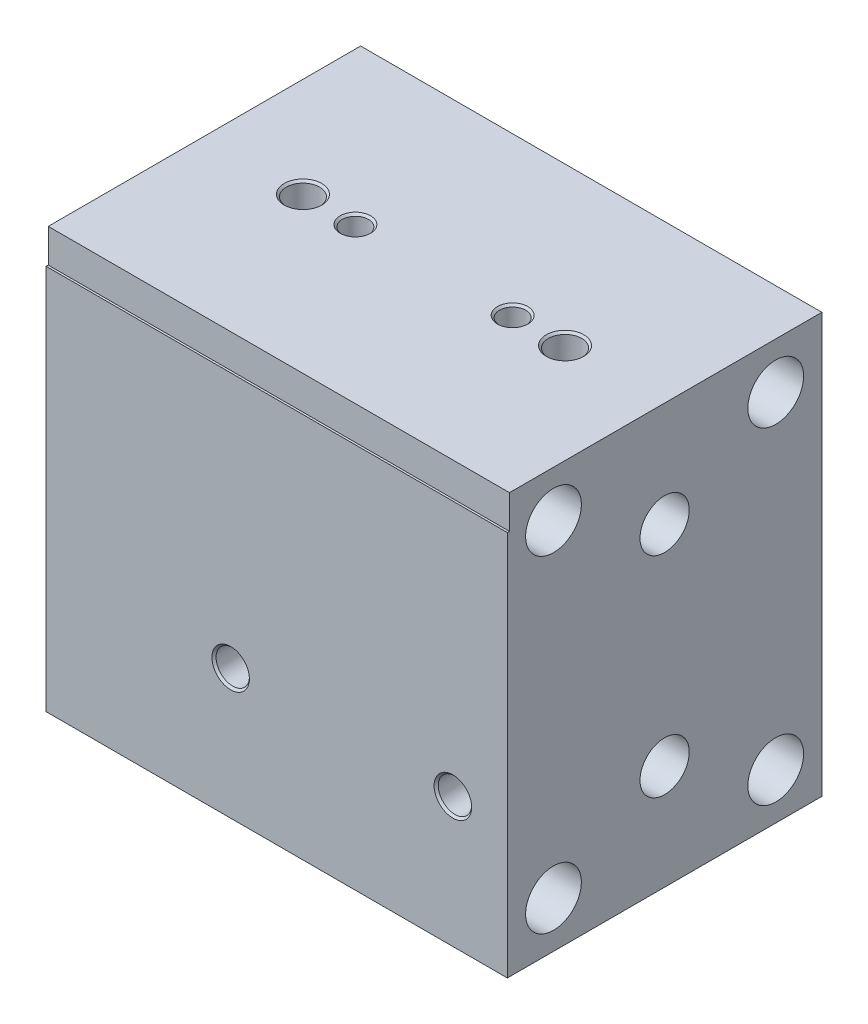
ISO-10303-21;
HEADER;
FILE_DESCRIPTION(('STEP AP214'),'2;1');
FILE_NAME('part.step','',(''),(''),'','','');
FILE_SCHEMA(('AUTOMOTIVE_DESIGN { 1 0 10303 214 1 1 1 1 }'));
ENDSEC;
DATA;
#1=APPLICATION_CONTEXT('core data for automotive mechanical design processes');
#2=APPLICATION_PROTOCOL_DEFINITION('international standard','automotive_design',2000,#1);
#3=PRODUCT_CONTEXT('',#1,'mechanical');
#4=PRODUCT('Part','Part','',(#3));
#5=PRODUCT_RELATED_PRODUCT_CATEGORY('part','',(#4));
#6=PRODUCT_DEFINITION_FORMATION('','',#4);
#7=PRODUCT_DEFINITION_CONTEXT('part definition',#1,'design');
#8=PRODUCT_DEFINITION('design','',#6,#7);
#9=PRODUCT_DEFINITION_SHAPE('','',#8);
#10=(LENGTH_UNIT() NAMED_UNIT(*) SI_UNIT(.MILLI.,.METRE.));
#11=(NAMED_UNIT(*) PLANE_ANGLE_UNIT() SI_UNIT($,.RADIAN.));
#12=(NAMED_UNIT(*) SI_UNIT($,.STERADIAN.) SOLID_ANGLE_UNIT());
#13=UNCERTAINTY_MEASURE_WITH_UNIT(LENGTH_MEASURE(1.E-05),#10,'distance_accuracy_value','');
#14=(GEOMETRIC_REPRESENTATION_CONTEXT(3) GLOBAL_UNCERTAINTY_ASSIGNED_CONTEXT((#13)) GLOBAL_UNIT_ASSIGNED_CONTEXT((#10,
#11,#12)) REPRESENTATION_CONTEXT('',''));
#15=CARTESIAN_POINT('',(0.,0.,0.));
#16=DIRECTION('',(0.,0.,1.));
#17=DIRECTION('',(1.,0.,0.));
#18=AXIS2_PLACEMENT_3D('',#15,#16,#17);
#19=CARTESIAN_POINT('',(-27.94,25.4,19.05));
#20=DIRECTION('',(1.,0.,0.));
#21=DIRECTION('',(0.,1.,0.));
#22=AXIS2_PLACEMENT_3D('',#19,#20,#21);
#23=PLANE('',#22);
#24=CARTESIAN_POINT('',(-27.94,-12.7,0.));
#25=DIRECTION('',(1.,0.,0.));
#26=DIRECTION('',(0.,0.,-1.));
#27=AXIS2_PLACEMENT_3D('',#24,#25,#26);
#28=CIRCLE('',#27,2.9845);
#29=CARTESIAN_POINT('',(-27.94,-12.7,-2.9845));
#30=VERTEX_POINT('',#29);
#31=EDGE_CURVE('E553',#30,#30,#28,.T.);
#32=ORIENTED_EDGE('',*,*,#31,.T.);
#33=EDGE_LOOP('',(#32));
#34=FACE_BOUND('',#33,.T.);
#35=CARTESIAN_POINT('',(-27.94,12.7,0.));
#36=DIRECTION('',(1.,0.,0.));
#37=DIRECTION('',(0.,0.,-1.));
#38=AXIS2_PLACEMENT_3D('',#35,#36,#37);
#39=CIRCLE('',#38,2.9845);
#40=CARTESIAN_POINT('',(-27.94,12.7,-2.9845));
#41=VERTEX_POINT('',#40);
#42=EDGE_CURVE('E552',#41,#41,#39,.T.);
#43=ORIENTED_EDGE('',*,*,#42,.T.);
#44=EDGE_LOOP('',(#43));
#45=FACE_BOUND('',#44,.T.);
#46=CARTESIAN_POINT('',(-27.94,-19.812,-13.462));
#47=DIRECTION('',(1.,0.,0.));
#48=DIRECTION('',(0.,0.,-1.));
#49=AXIS2_PLACEMENT_3D('',#46,#47,#48);
#50=CIRCLE('',#49,3.3782);
#51=CARTESIAN_POINT('',(-27.94,-19.812,-16.8402));
#52=VERTEX_POINT('',#51);
#53=EDGE_CURVE('E275',#52,#52,#50,.T.);
#54=ORIENTED_EDGE('',*,*,#53,.T.);
#55=EDGE_LOOP('',(#54));
#56=FACE_BOUND('',#55,.T.);
#57=CARTESIAN_POINT('',(-27.94,-19.812,13.462));
#58=DIRECTION('',(1.,0.,0.));
#59=DIRECTION('',(0.,0.,-1.));
#60=AXIS2_PLACEMENT_3D('',#57,#58,#59);
#61=CIRCLE('',#60,3.3782);
#62=CARTESIAN_POINT('',(-27.94,-19.812,10.0838));
#63=VERTEX_POINT('',#62);
#64=EDGE_CURVE('E536',#63,#63,#61,.T.);
#65=ORIENTED_EDGE('',*,*,#64,.T.);
#66=EDGE_LOOP('',(#65));
#67=FACE_BOUND('',#66,.T.);
#68=CARTESIAN_POINT('',(-27.94,19.812,-13.462));
#69=DIRECTION('',(1.,0.,0.));
#70=DIRECTION('',(0.,0.,-1.));
#71=AXIS2_PLACEMENT_3D('',#68,#69,#70);
#72=CIRCLE('',#71,3.3782);
#73=CARTESIAN_POINT('',(-27.94,19.812,-16.8402));
#74=VERTEX_POINT('',#73);
#75=EDGE_CURVE('E531',#74,#74,#72,.T.);
#76=ORIENTED_EDGE('',*,*,#75,.T.);
#77=EDGE_LOOP('',(#76));
#78=FACE_BOUND('',#77,.T.);
#79=CARTESIAN_POINT('',(-27.94,19.812,13.462));
#80=DIRECTION('',(1.,0.,0.));
#81=DIRECTION('',(0.,0.,-1.));
#82=AXIS2_PLACEMENT_3D('',#79,#80,#81);
#83=CIRCLE('',#82,3.3782);
#84=CARTESIAN_POINT('',(-27.94,19.812,10.0838));
#85=VERTEX_POINT('',#84);
#86=EDGE_CURVE('E452',#85,#85,#83,.T.);
#87=ORIENTED_EDGE('',*,*,#86,.T.);
#88=EDGE_LOOP('',(#87));
#89=FACE_BOUND('',#88,.T.);
#90=DIRECTION('',(0.,0.,-1.));
#91=VECTOR('',#90,1.);
#92=CARTESIAN_POINT('',(-27.94,21.336,19.05));
#93=LINE('',#92,#91);
#94=CARTESIAN_POINT('',(-27.94,21.336,19.05));
#95=VERTEX_POINT('',#94);
#96=CARTESIAN_POINT('',(-27.94,21.336,18.796));
#97=VERTEX_POINT('',#96);
#98=EDGE_CURVE('E57',#95,#97,#93,.T.);
#99=ORIENTED_EDGE('',*,*,#98,.T.);
#100=DIRECTION('',(0.,1.,0.));
#101=VECTOR('',#100,1.);
#102=CARTESIAN_POINT('',(-27.94,21.336,18.796));
#103=LINE('',#102,#101);
#104=CARTESIAN_POINT('',(-27.94,25.4,18.796));
#105=VERTEX_POINT('',#104);
#106=EDGE_CURVE('E92',#97,#105,#103,.T.);
#107=ORIENTED_EDGE('',*,*,#106,.T.);
#108=DIRECTION('',(0.,0.,-1.));
#109=VECTOR('',#108,1.);
#110=CARTESIAN_POINT('',(-27.94,25.4,19.05));
#111=LINE('',#110,#109);
#112=CARTESIAN_POINT('',(-27.94,25.4,-19.05));
#113=VERTEX_POINT('',#112);
#114=EDGE_CURVE('E86',#105,#113,#111,.T.);
#115=ORIENTED_EDGE('',*,*,#114,.T.);
#116=DIRECTION('',(0.,-1.,0.));
#117=VECTOR('',#116,1.);
#118=CARTESIAN_POINT('',(-27.94,25.4,-19.05));
#119=LINE('',#118,#117);
#120=CARTESIAN_POINT('',(-27.94,-25.4,-19.05));
#121=VERTEX_POINT('',#120);
#122=EDGE_CURVE('E90',#113,#121,#119,.T.);
#123=ORIENTED_EDGE('',*,*,#122,.T.);
#124=DIRECTION('',(0.,0.,-1.));
#125=VECTOR('',#124,1.);
#126=CARTESIAN_POINT('',(-27.94,-25.4,19.05));
#127=LINE('',#126,#125);
#128=CARTESIAN_POINT('',(-27.94,-25.4,19.05));
#129=VERTEX_POINT('',#128);
#130=EDGE_CURVE('E124',#129,#121,#127,.T.);
#131=ORIENTED_EDGE('',*,*,#130,.F.);
#132=DIRECTION('',(0.,-1.,0.));
#133=VECTOR('',#132,1.);
#134=CARTESIAN_POINT('',(-27.94,25.4,19.05));
#135=LINE('',#134,#133);
#136=EDGE_CURVE('E105',#95,#129,#135,.T.);
#137=ORIENTED_EDGE('',*,*,#136,.F.);
#138=EDGE_LOOP('',(#99,#107,#115,#123,#131,#137));
#139=FACE_BOUND('',#138,.T.);
#140=ADVANCED_FACE('F37',(#34,#45,#56,#67,#78,#89,#139),#23,.F.);
#141=CARTESIAN_POINT('',(-27.94,-25.4,19.05));
#142=DIRECTION('',(0.,1.,0.));
#143=DIRECTION('',(0.,0.,1.));
#144=AXIS2_PLACEMENT_3D('',#141,#142,#143);
#145=PLANE('',#144);
#146=DIRECTION('',(1.,0.,0.));
#147=VECTOR('',#146,1.);
#148=CARTESIAN_POINT('',(-27.94,-25.4,-19.05));
#149=LINE('',#148,#147);
#150=CARTESIAN_POINT('',(27.94,-25.4,-19.05));
#151=VERTEX_POINT('',#150);
#152=EDGE_CURVE('E109',#121,#151,#149,.T.);
#153=ORIENTED_EDGE('',*,*,#152,.T.);
#154=DIRECTION('',(0.,0.,-1.));
#155=VECTOR('',#154,1.);
#156=CARTESIAN_POINT('',(27.94,-25.4,19.05));
#157=LINE('',#156,#155);
#158=CARTESIAN_POINT('',(27.94,-25.4,19.05));
#159=VERTEX_POINT('',#158);
#160=EDGE_CURVE('E121',#159,#151,#157,.T.);
#161=ORIENTED_EDGE('',*,*,#160,.F.);
#162=DIRECTION('',(1.,0.,0.));
#163=VECTOR('',#162,1.);
#164=CARTESIAN_POINT('',(-27.94,-25.4,19.05));
#165=LINE('',#164,#163);
#166=EDGE_CURVE('E66',#129,#159,#165,.T.);
#167=ORIENTED_EDGE('',*,*,#166,.F.);
#168=ORIENTED_EDGE('',*,*,#130,.T.);
#169=EDGE_LOOP('',(#153,#161,#167,#168));
#170=FACE_BOUND('',#169,.T.);
#171=ADVANCED_FACE('F201',(#170),#145,.F.);
#172=CARTESIAN_POINT('',(27.94,-25.4,19.05));
#173=DIRECTION('',(-1.,0.,0.));
#174=DIRECTION('',(0.,0.,1.));
#175=AXIS2_PLACEMENT_3D('',#172,#173,#174);
#176=PLANE('',#175);
#177=CARTESIAN_POINT('',(27.94,-12.7,0.));
#178=DIRECTION('',(1.,0.,0.));
#179=DIRECTION('',(0.,0.,-1.));
#180=AXIS2_PLACEMENT_3D('',#177,#178,#179);
#181=CIRCLE('',#180,2.9845);
#182=CARTESIAN_POINT('',(27.94,-12.7,-2.9845));
#183=VERTEX_POINT('',#182);
#184=EDGE_CURVE('E513',#183,#183,#181,.T.);
#185=ORIENTED_EDGE('',*,*,#184,.F.);
#186=EDGE_LOOP('',(#185));
#187=FACE_BOUND('',#186,.T.);
#188=CARTESIAN_POINT('',(27.94,12.7,0.));
#189=DIRECTION('',(1.,0.,0.));
#190=DIRECTION('',(0.,0.,-1.));
#191=AXIS2_PLACEMENT_3D('',#188,#189,#190);
#192=CIRCLE('',#191,2.9845);
#193=CARTESIAN_POINT('',(27.94,12.7,-2.9845));
#194=VERTEX_POINT('',#193);
#195=EDGE_CURVE('E273',#194,#194,#192,.T.);
#196=ORIENTED_EDGE('',*,*,#195,.F.);
#197=EDGE_LOOP('',(#196));
#198=FACE_BOUND('',#197,.T.);
#199=CARTESIAN_POINT('',(27.94,-19.812,-13.462));
#200=DIRECTION('',(1.,0.,0.));
#201=DIRECTION('',(0.,0.,-1.));
#202=AXIS2_PLACEMENT_3D('',#199,#200,#201);
#203=CIRCLE('',#202,3.3782);
#204=CARTESIAN_POINT('',(27.94,-19.812,-16.8402));
#205=VERTEX_POINT('',#204);
#206=EDGE_CURVE('E272',#205,#205,#203,.T.);
#207=ORIENTED_EDGE('',*,*,#206,.F.);
#208=EDGE_LOOP('',(#207));
#209=FACE_BOUND('',#208,.T.);
#210=CARTESIAN_POINT('',(27.94,-19.812,13.462));
#211=DIRECTION('',(1.,0.,0.));
#212=DIRECTION('',(0.,0.,-1.));
#213=AXIS2_PLACEMENT_3D('',#210,#211,#212);
#214=CIRCLE('',#213,3.3782);
#215=CARTESIAN_POINT('',(27.94,-19.812,10.0838));
#216=VERTEX_POINT('',#215);
#217=EDGE_CURVE('E523',#216,#216,#214,.T.);
#218=ORIENTED_EDGE('',*,*,#217,.F.);
#219=EDGE_LOOP('',(#218));
#220=FACE_BOUND('',#219,.T.);
#221=CARTESIAN_POINT('',(27.94,19.812,-13.462));
#222=DIRECTION('',(1.,0.,0.));
#223=DIRECTION('',(0.,0.,-1.));
#224=AXIS2_PLACEMENT_3D('',#221,#222,#223);
#225=CIRCLE('',#224,3.3782);
#226=CARTESIAN_POINT('',(27.94,19.812,-16.8402));
#227=VERTEX_POINT('',#226);
#228=EDGE_CURVE('E527',#227,#227,#225,.T.);
#229=ORIENTED_EDGE('',*,*,#228,.F.);
#230=EDGE_LOOP('',(#229));
#231=FACE_BOUND('',#230,.T.);
#232=CARTESIAN_POINT('',(27.94,19.812,13.462));
#233=DIRECTION('',(1.,0.,0.));
#234=DIRECTION('',(0.,0.,-1.));
#235=AXIS2_PLACEMENT_3D('',#232,#233,#234);
#236=CIRCLE('',#235,3.3782);
#237=CARTESIAN_POINT('',(27.94,19.812,10.0838));
#238=VERTEX_POINT('',#237);
#239=EDGE_CURVE('E458',#238,#238,#236,.T.);
#240=ORIENTED_EDGE('',*,*,#239,.F.);
#241=EDGE_LOOP('',(#240));
#242=FACE_BOUND('',#241,.T.);
#243=DIRECTION('',(0.,0.,-1.));
#244=VECTOR('',#243,1.);
#245=CARTESIAN_POINT('',(27.94,25.4,19.05));
#246=LINE('',#245,#244);
#247=CARTESIAN_POINT('',(27.94,25.4,18.796));
#248=VERTEX_POINT('',#247);
#249=CARTESIAN_POINT('',(27.94,25.4,-19.05));
#250=VERTEX_POINT('',#249);
#251=EDGE_CURVE('E95',#248,#250,#246,.T.);
#252=ORIENTED_EDGE('',*,*,#251,.F.);
#253=DIRECTION('',(0.,1.,0.));
#254=VECTOR('',#253,1.);
#255=CARTESIAN_POINT('',(27.94,21.336,18.796));
#256=LINE('',#255,#254);
#257=CARTESIAN_POINT('',(27.94,21.336,18.796));
#258=VERTEX_POINT('',#257);
#259=EDGE_CURVE('E387',#258,#248,#256,.T.);
#260=ORIENTED_EDGE('',*,*,#259,.F.);
#261=DIRECTION('',(0.,0.,-1.));
#262=VECTOR('',#261,1.);
#263=CARTESIAN_POINT('',(27.94,21.336,19.05));
#264=LINE('',#263,#262);
#265=CARTESIAN_POINT('',(27.94,21.336,19.05));
#266=VERTEX_POINT('',#265);
#267=EDGE_CURVE('E383',#266,#258,#264,.T.);
#268=ORIENTED_EDGE('',*,*,#267,.F.);
#269=DIRECTION('',(0.,1.,0.));
#270=VECTOR('',#269,1.);
#271=CARTESIAN_POINT('',(27.94,-25.4,19.05));
#272=LINE('',#271,#270);
#273=EDGE_CURVE('E96',#159,#266,#272,.T.);
#274=ORIENTED_EDGE('',*,*,#273,.F.);
#275=ORIENTED_EDGE('',*,*,#160,.T.);
#276=DIRECTION('',(0.,1.,0.));
#277=VECTOR('',#276,1.);
#278=CARTESIAN_POINT('',(27.94,-25.4,-19.05));
#279=LINE('',#278,#277);
#280=EDGE_CURVE('E106',#151,#250,#279,.T.);
#281=ORIENTED_EDGE('',*,*,#280,.T.);
#282=EDGE_LOOP('',(#252,#260,#268,#274,#275,#281));
#283=FACE_BOUND('',#282,.T.);
#284=ADVANCED_FACE('F207',(#187,#198,#209,#220,#231,#242,#283),#176,.F.);
#285=CARTESIAN_POINT('',(27.94,25.4,19.05));
#286=DIRECTION('',(0.,-1.,0.));
#287=DIRECTION('',(1.,0.,0.));
#288=AXIS2_PLACEMENT_3D('',#285,#286,#287);
#289=PLANE('',#288);
#290=CARTESIAN_POINT('',(15.875,25.4,0.));
#291=DIRECTION('',(0.,-1.,0.));
#292=DIRECTION('',(1.,0.,0.));
#293=AXIS2_PLACEMENT_3D('',#290,#291,#292);
#294=CIRCLE('',#293,2.2733);
#295=CARTESIAN_POINT('',(18.1483,25.4,0.));
#296=VERTEX_POINT('',#295);
#297=EDGE_CURVE('E174',#296,#296,#294,.T.);
#298=ORIENTED_EDGE('',*,*,#297,.T.);
#299=EDGE_LOOP('',(#298));
#300=FACE_BOUND('',#299,.T.);
#301=CARTESIAN_POINT('',(9.525,25.4,0.));
#302=DIRECTION('',(0.,-1.,0.));
#303=DIRECTION('',(1.,0.,0.));
#304=AXIS2_PLACEMENT_3D('',#301,#302,#303);
#305=CIRCLE('',#304,1.84150000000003);
#306=CARTESIAN_POINT('',(11.3665,25.4,0.));
#307=VERTEX_POINT('',#306);
#308=EDGE_CURVE('E171',#307,#307,#305,.T.);
#309=ORIENTED_EDGE('',*,*,#308,.T.);
#310=EDGE_LOOP('',(#309));
#311=FACE_BOUND('',#310,.T.);
#312=CARTESIAN_POINT('',(-9.525,25.4,0.));
#313=DIRECTION('',(0.,-1.,0.));
#314=DIRECTION('',(1.,0.,0.));
#315=AXIS2_PLACEMENT_3D('',#312,#313,#314);
#316=CIRCLE('',#315,1.84150000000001);
#317=CARTESIAN_POINT('',(-7.6835,25.4,0.));
#318=VERTEX_POINT('',#317);
#319=EDGE_CURVE('E168',#318,#318,#316,.T.);
#320=ORIENTED_EDGE('',*,*,#319,.T.);
#321=EDGE_LOOP('',(#320));
#322=FACE_BOUND('',#321,.T.);
#323=CARTESIAN_POINT('',(-15.875,25.4,0.));
#324=DIRECTION('',(0.,-1.,0.));
#325=DIRECTION('',(1.,0.,0.));
#326=AXIS2_PLACEMENT_3D('',#323,#324,#325);
#327=CIRCLE('',#326,2.27329999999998);
#328=CARTESIAN_POINT('',(-13.6017,25.4,0.));
#329=VERTEX_POINT('',#328);
#330=EDGE_CURVE('E165',#329,#329,#327,.T.);
#331=ORIENTED_EDGE('',*,*,#330,.T.);
#332=EDGE_LOOP('',(#331));
#333=FACE_BOUND('',#332,.T.);
#334=ORIENTED_EDGE('',*,*,#114,.F.);
#335=DIRECTION('',(1.,0.,0.));
#336=VECTOR('',#335,1.);
#337=CARTESIAN_POINT('',(-27.94,25.4,18.796));
#338=LINE('',#337,#336);
#339=EDGE_CURVE('E111',#105,#248,#338,.T.);
#340=ORIENTED_EDGE('',*,*,#339,.T.);
#341=ORIENTED_EDGE('',*,*,#251,.T.);
#342=DIRECTION('',(-1.,0.,0.));
#343=VECTOR('',#342,1.);
#344=CARTESIAN_POINT('',(27.94,25.4,-19.05));
#345=LINE('',#344,#343);
#346=EDGE_CURVE('E99',#250,#113,#345,.T.);
#347=ORIENTED_EDGE('',*,*,#346,.T.);
#348=EDGE_LOOP('',(#334,#340,#341,#347));
#349=FACE_BOUND('',#348,.T.);
#350=ADVANCED_FACE('F100',(#300,#311,#322,#333,#349),#289,.F.);
#351=CARTESIAN_POINT('',(-27.94,25.4,19.05));
#352=DIRECTION('',(0.,0.,-1.));
#353=DIRECTION('',(-1.,0.,0.));
#354=AXIS2_PLACEMENT_3D('',#351,#352,#353);
#355=PLANE('',#354);
#356=CARTESIAN_POINT('',(-5.588,-9.652,19.05));
#357=DIRECTION('',(0.,0.,-1.));
#358=DIRECTION('',(-1.,0.,0.));
#359=AXIS2_PLACEMENT_3D('',#356,#357,#358);
#360=CIRCLE('',#359,2.27329999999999);
#361=CARTESIAN_POINT('',(-7.86129999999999,-9.652,19.05));
#362=VERTEX_POINT('',#361);
#363=EDGE_CURVE('E156',#362,#362,#360,.T.);
#364=ORIENTED_EDGE('',*,*,#363,.T.);
#365=EDGE_LOOP('',(#364));
#366=FACE_BOUND('',#365,.T.);
#367=CARTESIAN_POINT('',(21.336,-9.652,19.05));
#368=DIRECTION('',(0.,0.,-1.));
#369=DIRECTION('',(-1.,0.,0.));
#370=AXIS2_PLACEMENT_3D('',#367,#368,#369);
#371=CIRCLE('',#370,2.27329999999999);
#372=CARTESIAN_POINT('',(19.0627,-9.652,19.05));
#373=VERTEX_POINT('',#372);
#374=EDGE_CURVE('E153',#373,#373,#371,.T.);
#375=ORIENTED_EDGE('',*,*,#374,.T.);
#376=EDGE_LOOP('',(#375));
#377=FACE_BOUND('',#376,.T.);
#378=ORIENTED_EDGE('',*,*,#273,.T.);
#379=DIRECTION('',(1.,0.,0.));
#380=VECTOR('',#379,1.);
#381=CARTESIAN_POINT('',(-27.94,21.336,19.05));
#382=LINE('',#381,#380);
#383=EDGE_CURVE('E395',#95,#266,#382,.T.);
#384=ORIENTED_EDGE('',*,*,#383,.F.);
#385=ORIENTED_EDGE('',*,*,#136,.T.);
#386=ORIENTED_EDGE('',*,*,#166,.T.);
#387=EDGE_LOOP('',(#378,#384,#385,#386));
#388=FACE_BOUND('',#387,.T.);
#389=ADVANCED_FACE('F404',(#366,#377,#388),#355,.F.);
#390=CARTESIAN_POINT('',(-27.94,25.4,-19.05));
#391=DIRECTION('',(0.,0.,-1.));
#392=DIRECTION('',(-1.,0.,0.));
#393=AXIS2_PLACEMENT_3D('',#390,#391,#392);
#394=PLANE('',#393);
#395=CARTESIAN_POINT('',(-9.525,9.525,-19.05));
#396=DIRECTION('',(0.,0.,-1.));
#397=DIRECTION('',(-1.,0.,0.));
#398=AXIS2_PLACEMENT_3D('',#395,#396,#397);
#399=CIRCLE('',#398,1.9812);
#400=CARTESIAN_POINT('',(-11.5062,9.525,-19.05));
#401=VERTEX_POINT('',#400);
#402=EDGE_CURVE('E138',#401,#401,#399,.F.);
#403=ORIENTED_EDGE('',*,*,#402,.T.);
#404=EDGE_LOOP('',(#403));
#405=FACE_BOUND('',#404,.T.);
#406=CARTESIAN_POINT('',(0.,-9.525,-19.05));
#407=DIRECTION('',(0.,0.,-1.));
#408=DIRECTION('',(-1.,0.,0.));
#409=AXIS2_PLACEMENT_3D('',#406,#407,#408);
#410=CIRCLE('',#409,1.84150000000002);
#411=CARTESIAN_POINT('',(-1.84150000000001,-9.525,-19.05));
#412=VERTEX_POINT('',#411);
#413=EDGE_CURVE('E135',#412,#412,#410,.F.);
#414=ORIENTED_EDGE('',*,*,#413,.T.);
#415=EDGE_LOOP('',(#414));
#416=FACE_BOUND('',#415,.T.);
#417=CARTESIAN_POINT('',(0.,9.525,-19.05));
#418=DIRECTION('',(0.,0.,-1.));
#419=DIRECTION('',(-1.,0.,0.));
#420=AXIS2_PLACEMENT_3D('',#417,#418,#419);
#421=CIRCLE('',#420,1.84150000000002);
#422=CARTESIAN_POINT('',(-1.84150000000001,9.525,-19.05));
#423=VERTEX_POINT('',#422);
#424=EDGE_CURVE('E132',#423,#423,#421,.F.);
#425=ORIENTED_EDGE('',*,*,#424,.T.);
#426=EDGE_LOOP('',(#425));
#427=FACE_BOUND('',#426,.T.);
#428=CARTESIAN_POINT('',(9.525,9.525,-19.05));
#429=DIRECTION('',(0.,0.,-1.));
#430=DIRECTION('',(-1.,0.,0.));
#431=AXIS2_PLACEMENT_3D('',#428,#429,#430);
#432=CIRCLE('',#431,1.9812);
#433=CARTESIAN_POINT('',(7.54380000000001,9.525,-19.05));
#434=VERTEX_POINT('',#433);
#435=EDGE_CURVE('E129',#434,#434,#432,.F.);
#436=ORIENTED_EDGE('',*,*,#435,.T.);
#437=EDGE_LOOP('',(#436));
#438=FACE_BOUND('',#437,.T.);
#439=CARTESIAN_POINT('',(9.525,-9.525,-19.05));
#440=DIRECTION('',(0.,0.,-1.));
#441=DIRECTION('',(-1.,0.,0.));
#442=AXIS2_PLACEMENT_3D('',#439,#440,#441);
#443=CIRCLE('',#442,1.7272);
#444=CARTESIAN_POINT('',(7.7978,-9.525,-19.05));
#445=VERTEX_POINT('',#444);
#446=EDGE_CURVE('E467',#445,#445,#443,.T.);
#447=ORIENTED_EDGE('',*,*,#446,.F.);
#448=EDGE_LOOP('',(#447));
#449=FACE_BOUND('',#448,.T.);
#450=CARTESIAN_POINT('',(-9.525,-9.525,-19.05));
#451=DIRECTION('',(0.,0.,-1.));
#452=DIRECTION('',(-1.,0.,0.));
#453=AXIS2_PLACEMENT_3D('',#450,#451,#452);
#454=CIRCLE('',#453,1.7272);
#455=CARTESIAN_POINT('',(-11.2522,-9.525,-19.05));
#456=VERTEX_POINT('',#455);
#457=EDGE_CURVE('E473',#456,#456,#454,.T.);
#458=ORIENTED_EDGE('',*,*,#457,.F.);
#459=EDGE_LOOP('',(#458));
#460=FACE_BOUND('',#459,.T.);
#461=ORIENTED_EDGE('',*,*,#122,.F.);
#462=ORIENTED_EDGE('',*,*,#346,.F.);
#463=ORIENTED_EDGE('',*,*,#280,.F.);
#464=ORIENTED_EDGE('',*,*,#152,.F.);
#465=EDGE_LOOP('',(#461,#462,#463,#464));
#466=FACE_BOUND('',#465,.T.);
#467=ADVANCED_FACE('F108',(#405,#416,#427,#438,#449,#460,#466),#394,.T.);
#468=CARTESIAN_POINT('',(-27.94,21.336,18.796));
#469=DIRECTION('',(0.,0.,-1.));
#470=DIRECTION('',(-1.,0.,0.));
#471=AXIS2_PLACEMENT_3D('',#468,#469,#470);
#472=PLANE('',#471);
#473=ORIENTED_EDGE('',*,*,#259,.T.);
#474=ORIENTED_EDGE('',*,*,#339,.F.);
#475=ORIENTED_EDGE('',*,*,#106,.F.);
#476=DIRECTION('',(1.,0.,0.));
#477=VECTOR('',#476,1.);
#478=CARTESIAN_POINT('',(-27.94,21.336,18.796));
#479=LINE('',#478,#477);
#480=EDGE_CURVE('E114',#97,#258,#479,.T.);
#481=ORIENTED_EDGE('',*,*,#480,.T.);
#482=EDGE_LOOP('',(#473,#474,#475,#481));
#483=FACE_BOUND('',#482,.T.);
#484=ADVANCED_FACE('F259',(#483),#472,.F.);
#485=CARTESIAN_POINT('',(-27.94,21.336,19.05));
#486=DIRECTION('',(0.,-1.,0.));
#487=DIRECTION('',(0.,0.,-1.));
#488=AXIS2_PLACEMENT_3D('',#485,#486,#487);
#489=PLANE('',#488);
#490=ORIENTED_EDGE('',*,*,#267,.T.);
#491=ORIENTED_EDGE('',*,*,#480,.F.);
#492=ORIENTED_EDGE('',*,*,#98,.F.);
#493=ORIENTED_EDGE('',*,*,#383,.T.);
#494=EDGE_LOOP('',(#490,#491,#492,#493));
#495=FACE_BOUND('',#494,.T.);
#496=ADVANCED_FACE('F250',(#495),#489,.F.);
#497=CARTESIAN_POINT('',(15.875,25.4,0.));
#498=DIRECTION('',(0.,1.,0.));
#499=DIRECTION('',(0.,0.,1.));
#500=AXIS2_PLACEMENT_3D('',#497,#498,#499);
#501=CYLINDRICAL_SURFACE('',#500,2.0193);
#502=CARTESIAN_POINT('',(15.875,14.8976505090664,2.0193));
#503=CARTESIAN_POINT('',(15.7768989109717,14.8976570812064,2.01929636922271));
#504=CARTESIAN_POINT('',(15.6787772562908,14.9043421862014,2.01208925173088));
#505=CARTESIAN_POINT('',(15.4860826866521,14.9297371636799,1.98389638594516));
#506=CARTESIAN_POINT('',(15.3915166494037,14.948469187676,1.96288525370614));
#507=CARTESIAN_POINT('',(15.209348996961,14.9945673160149,1.90877857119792));
#508=CARTESIAN_POINT('',(15.1216875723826,15.0218458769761,1.87580503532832));
#509=CARTESIAN_POINT('',(14.9532988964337,15.0818060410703,1.79905817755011));
#510=CARTESIAN_POINT('',(14.8725728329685,15.1144885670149,1.75528301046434));
#511=CARTESIAN_POINT('',(14.7060919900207,15.1878823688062,1.64997909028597));
#512=CARTESIAN_POINT('',(14.6216239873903,15.2290386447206,1.58672602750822));
#513=CARTESIAN_POINT('',(14.463366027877,15.3110926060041,1.4477445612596));
#514=CARTESIAN_POINT('',(14.389588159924,15.3519899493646,1.37200223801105));
#515=CARTESIAN_POINT('',(14.243726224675,15.4361757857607,1.19642452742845));
#516=CARTESIAN_POINT('',(14.1735801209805,15.4788928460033,1.0946780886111));
#517=CARTESIAN_POINT('',(14.0520569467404,15.5549162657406,0.877416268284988));
#518=CARTESIAN_POINT('',(14.0006451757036,15.5882399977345,0.761926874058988));
#519=CARTESIAN_POINT('',(13.9301084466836,15.6345811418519,0.551345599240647));
#520=CARTESIAN_POINT('',(13.9060967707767,15.6506079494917,0.458540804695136));
#521=CARTESIAN_POINT('',(13.871450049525,15.6738376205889,0.269405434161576));
#522=CARTESIAN_POINT('',(13.8608047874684,15.6810472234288,0.173077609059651));
#523=CARTESIAN_POINT('',(13.853477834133,15.6860027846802,-0.0205153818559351));
#524=CARTESIAN_POINT('',(13.8568193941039,15.6837329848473,-0.117781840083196));
#525=CARTESIAN_POINT('',(13.877319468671,15.6699055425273,-0.310177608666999));
#526=CARTESIAN_POINT('',(13.8944820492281,15.6583451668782,-0.405306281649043));
#527=CARTESIAN_POINT('',(13.9412723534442,15.6272295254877,-0.58916541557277));
#528=CARTESIAN_POINT('',(13.9706719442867,15.6078207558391,-0.677979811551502));
#529=CARTESIAN_POINT('',(14.0406400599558,15.5624876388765,-0.849273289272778));
#530=CARTESIAN_POINT('',(14.0812107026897,15.5365620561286,-0.931751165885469));
#531=CARTESIAN_POINT('',(14.1773631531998,15.4766999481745,-1.09811074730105));
#532=CARTESIAN_POINT('',(14.2341215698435,15.4421898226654,-1.18110264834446));
#533=CARTESIAN_POINT('',(14.3583991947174,15.3696810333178,-1.33695510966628));
#534=CARTESIAN_POINT('',(14.4259309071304,15.3316783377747,-1.40980371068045));
#535=CARTESIAN_POINT('',(14.5828187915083,15.2483805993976,-1.55602101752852));
#536=CARTESIAN_POINT('',(14.6739354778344,15.2029329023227,-1.62742158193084));
#537=CARTESIAN_POINT('',(14.8682768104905,15.1157048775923,-1.75428854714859));
#538=CARTESIAN_POINT('',(14.9714944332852,15.0739224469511,-1.80976412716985));
#539=CARTESIAN_POINT('',(15.1631137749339,15.008764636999,-1.89180212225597));
#540=CARTESIAN_POINT('',(15.2492194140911,14.9833740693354,-1.92210169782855));
#541=CARTESIAN_POINT('',(15.4266621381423,14.9412697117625,-1.97104094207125));
#542=CARTESIAN_POINT('',(15.5179893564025,14.9245401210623,-1.989701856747));
#543=CARTESIAN_POINT('',(15.7045233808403,14.9023000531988,-2.01430206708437));
#544=CARTESIAN_POINT('',(15.7997554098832,14.8968805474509,-2.0201382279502));
#545=CARTESIAN_POINT('',(15.989976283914,14.8986000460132,-2.01826632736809));
#546=CARTESIAN_POINT('',(16.0849651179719,14.9057396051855,-2.01055766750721));
#547=CARTESIAN_POINT('',(16.2610627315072,14.9297794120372,-1.98383120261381));
#548=CARTESIAN_POINT('',(16.3425481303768,14.9455182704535,-1.96615219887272));
#549=CARTESIAN_POINT('',(16.5012515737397,14.9838380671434,-1.92150676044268));
#550=CARTESIAN_POINT('',(16.5784656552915,15.0064252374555,-1.8945318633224));
#551=CARTESIAN_POINT('',(16.761439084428,15.0674858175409,-1.81812570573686));
#552=CARTESIAN_POINT('',(16.8644034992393,15.1085336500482,-1.76405169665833));
#553=CARTESIAN_POINT('',(17.0585945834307,15.1945869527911,-1.64011771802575));
#554=CARTESIAN_POINT('',(17.1497991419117,15.2395996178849,-1.57022867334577));
#555=CARTESIAN_POINT('',(17.3205035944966,15.3294155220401,-1.41477469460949));
#556=CARTESIAN_POINT('',(17.3998287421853,15.3742077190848,-1.32901076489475));
#557=CARTESIAN_POINT('',(17.5434059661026,15.4586017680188,-1.1435470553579));
#558=CARTESIAN_POINT('',(17.6076819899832,15.498211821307,-1.04386982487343));
#559=CARTESIAN_POINT('',(17.7088365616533,15.5620587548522,-0.851040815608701));
#560=CARTESIAN_POINT('',(17.7485532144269,15.5877764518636,-0.759872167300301));
#561=CARTESIAN_POINT('',(17.8144888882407,15.6309829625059,-0.57091703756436));
#562=CARTESIAN_POINT('',(17.8407165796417,15.6484770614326,-0.473134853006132));
#563=CARTESIAN_POINT('',(17.8783591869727,15.6737044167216,-0.273007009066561));
#564=CARTESIAN_POINT('',(17.8897040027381,15.6813914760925,-0.170642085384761));
#565=CARTESIAN_POINT('',(17.8966128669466,15.6860640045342,0.0348625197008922));
#566=CARTESIAN_POINT('',(17.8921799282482,15.6830515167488,0.13800204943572));
#567=CARTESIAN_POINT('',(17.8688118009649,15.6673034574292,0.33348316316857));
#568=CARTESIAN_POINT('',(17.8510500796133,15.655354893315,0.426034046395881));
#569=CARTESIAN_POINT('',(17.8033252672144,15.6236601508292,0.60650801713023));
#570=CARTESIAN_POINT('',(17.7733602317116,15.6039127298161,0.694430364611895));
#571=CARTESIAN_POINT('',(17.7006142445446,15.5568732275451,0.868364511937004));
#572=CARTESIAN_POINT('',(17.6572444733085,15.5292402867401,0.954035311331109));
#573=CARTESIAN_POINT('',(17.5598357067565,15.468912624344,1.11711050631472));
#574=CARTESIAN_POINT('',(17.5057909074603,15.4362151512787,1.19451036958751));
#575=CARTESIAN_POINT('',(17.378963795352,15.3624233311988,1.35182501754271));
#576=CARTESIAN_POINT('',(17.3045698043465,15.3208189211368,1.43020061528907));
#577=CARTESIAN_POINT('',(17.144421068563,15.2370122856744,1.57408603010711));
#578=CARTESIAN_POINT('',(17.0586566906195,15.1948095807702,1.63958481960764));
#579=CARTESIAN_POINT('',(16.881497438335,15.1159365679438,1.75357711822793));
#580=CARTESIAN_POINT('',(16.7906464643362,15.0790912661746,1.80279103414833));
#581=CARTESIAN_POINT('',(16.6003141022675,15.0125419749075,1.88740387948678));
#582=CARTESIAN_POINT('',(16.5008476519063,14.9828259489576,1.9228261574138));
#583=CARTESIAN_POINT('',(16.3140102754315,14.9395892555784,1.97291020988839));
#584=CARTESIAN_POINT('',(16.2278167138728,14.9240872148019,1.99020368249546));
#585=CARTESIAN_POINT('',(16.05275205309,14.9031211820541,2.01339304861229));
#586=CARTESIAN_POINT('',(15.9638844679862,14.8976445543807,2.01930328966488));
#587=CARTESIAN_POINT('',(15.875,14.8976505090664,2.0193));
#588=B_SPLINE_CURVE_WITH_KNOTS('',3,(#502,#503,#504,#505,#506,#507,#508,#509,#510,#511,#512,
#513,#514,#515,#516,#517,#518,#519,#520,#521,#522,#523,#524,#525,#526,#527,#528,#529,#530,#531,
#532,#533,#534,#535,#536,#537,#538,#539,#540,#541,#542,#543,#544,#545,#546,#547,#548,#549,#550,
#551,#552,#553,#554,#555,#556,#557,#558,#559,#560,#561,#562,#563,#564,#565,#566,#567,#568,#569,
#570,#571,#572,#573,#574,#575,#576,#577,#578,#579,#580,#581,#582,#583,#584,#585,#586,#587),
.UNSPECIFIED.,.T.,.F.,(4,2,2,2,2,2,2,2,2,2,2,2,2,2,2,2,2,2,2,2,2,2,2,2,2,2,2,2,2,2,2,2,2,2,2,2,
2,2,2,2,2,2,4),(0.,0.29389492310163,0.588331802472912,0.879846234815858,1.1714104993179,
1.50997080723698,1.84891103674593,2.23903110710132,2.6284248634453,2.91873844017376,
3.20882997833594,3.49940394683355,3.79006342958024,4.07553104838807,4.36105282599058,
4.67876021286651,4.99683907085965,5.36834774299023,5.73964184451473,6.02283246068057,
6.30550459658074,6.59044174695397,6.87539148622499,7.12896344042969,7.38276684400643,
7.750809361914,8.11953408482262,8.49323949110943,8.86634611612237,9.17321413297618,
9.47988465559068,9.7879945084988,10.0960455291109,10.3797580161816,10.6635157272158,
10.9621289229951,11.2609049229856,11.6069465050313,11.953283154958,12.2811565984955,
12.6084725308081,12.8750922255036,13.1413756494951),.UNSPECIFIED.);
#589=CARTESIAN_POINT('',(15.875,14.8976505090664,2.0193));
#590=VERTEX_POINT('',#589);
#591=EDGE_CURVE('E267',#590,#590,#588,.T.);
#592=ORIENTED_EDGE('',*,*,#591,.T.);
#593=EDGE_LOOP('',(#592));
#594=FACE_BOUND('',#593,.T.);
#595=CARTESIAN_POINT('',(15.875,25.146,0.));
#596=DIRECTION('',(0.,-1.,0.));
#597=DIRECTION('',(0.,0.,-1.));
#598=AXIS2_PLACEMENT_3D('',#595,#596,#597);
#599=CIRCLE('',#598,2.0193);
#600=CARTESIAN_POINT('',(15.875,25.146,-2.0193));
#601=VERTEX_POINT('',#600);
#602=EDGE_CURVE('E162',#601,#601,#599,.F.);
#603=ORIENTED_EDGE('',*,*,#602,.T.);
#604=EDGE_LOOP('',(#603));
#605=FACE_BOUND('',#604,.T.);
#606=ADVANCED_FACE('F247',(#594,#605),#501,.F.);
#607=CARTESIAN_POINT('',(-15.875,25.4,0.));
#608=DIRECTION('',(0.,1.,0.));
#609=DIRECTION('',(0.,0.,1.));
#610=AXIS2_PLACEMENT_3D('',#607,#608,#609);
#611=CYLINDRICAL_SURFACE('',#610,2.0193);
#612=CARTESIAN_POINT('',(-15.875,14.8976505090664,2.0193));
#613=CARTESIAN_POINT('',(-15.9731010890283,14.8976570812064,2.01929636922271));
#614=CARTESIAN_POINT('',(-16.0712227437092,14.9043421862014,2.01208925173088));
#615=CARTESIAN_POINT('',(-16.2639173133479,14.9297371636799,1.98389638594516));
#616=CARTESIAN_POINT('',(-16.3584833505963,14.948469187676,1.96288525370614));
#617=CARTESIAN_POINT('',(-16.540651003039,14.9945673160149,1.90877857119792));
#618=CARTESIAN_POINT('',(-16.6283124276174,15.0218458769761,1.87580503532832));
#619=CARTESIAN_POINT('',(-16.7967011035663,15.0818060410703,1.79905817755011));
#620=CARTESIAN_POINT('',(-16.8774271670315,15.1144885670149,1.75528301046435));
#621=CARTESIAN_POINT('',(-17.0439080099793,15.1878823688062,1.64997909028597));
#622=CARTESIAN_POINT('',(-17.1283760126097,15.2290386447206,1.58672602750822));
#623=CARTESIAN_POINT('',(-17.286633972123,15.3110926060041,1.44774456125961));
#624=CARTESIAN_POINT('',(-17.360411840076,15.3519899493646,1.37200223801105));
#625=CARTESIAN_POINT('',(-17.506273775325,15.4361757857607,1.19642452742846));
#626=CARTESIAN_POINT('',(-17.5764198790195,15.4788928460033,1.09467808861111));
#627=CARTESIAN_POINT('',(-17.6979430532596,15.5549162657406,0.877416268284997));
#628=CARTESIAN_POINT('',(-17.7493548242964,15.5882399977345,0.761926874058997));
#629=CARTESIAN_POINT('',(-17.8198915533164,15.6345811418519,0.551345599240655));
#630=CARTESIAN_POINT('',(-17.8439032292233,15.6506079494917,0.458540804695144));
#631=CARTESIAN_POINT('',(-17.878549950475,15.6738376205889,0.269405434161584));
#632=CARTESIAN_POINT('',(-17.8891952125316,15.6810472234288,0.173077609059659));
#633=CARTESIAN_POINT('',(-17.896522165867,15.6860027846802,-0.0205153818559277));
#634=CARTESIAN_POINT('',(-17.8931806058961,15.6837329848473,-0.117781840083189));
#635=CARTESIAN_POINT('',(-17.872680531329,15.6699055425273,-0.310177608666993));
#636=CARTESIAN_POINT('',(-17.8555179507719,15.6583451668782,-0.405306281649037));
#637=CARTESIAN_POINT('',(-17.8087276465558,15.6272295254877,-0.589165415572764));
#638=CARTESIAN_POINT('',(-17.7793280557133,15.6078207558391,-0.677979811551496));
#639=CARTESIAN_POINT('',(-17.7093599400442,15.5624876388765,-0.849273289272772));
#640=CARTESIAN_POINT('',(-17.6687892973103,15.5365620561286,-0.931751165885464));
#641=CARTESIAN_POINT('',(-17.5726368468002,15.4766999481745,-1.09811074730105));
#642=CARTESIAN_POINT('',(-17.5158784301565,15.4421898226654,-1.18110264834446));
#643=CARTESIAN_POINT('',(-17.3916008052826,15.3696810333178,-1.33695510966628));
#644=CARTESIAN_POINT('',(-17.3240690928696,15.3316783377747,-1.40980371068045));
#645=CARTESIAN_POINT('',(-17.1671812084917,15.2483805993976,-1.55602101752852));
#646=CARTESIAN_POINT('',(-17.0760645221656,15.2029329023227,-1.62742158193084));
#647=CARTESIAN_POINT('',(-16.8817231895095,15.1157048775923,-1.75428854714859));
#648=CARTESIAN_POINT('',(-16.7785055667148,15.0739224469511,-1.80976412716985));
#649=CARTESIAN_POINT('',(-16.5868862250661,15.008764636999,-1.89180212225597));
#650=CARTESIAN_POINT('',(-16.5007805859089,14.9833740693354,-1.92210169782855));
#651=CARTESIAN_POINT('',(-16.3233378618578,14.9412697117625,-1.97104094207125));
#652=CARTESIAN_POINT('',(-16.2320106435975,14.9245401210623,-1.989701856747));
#653=CARTESIAN_POINT('',(-16.0454766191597,14.9023000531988,-2.01430206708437));
#654=CARTESIAN_POINT('',(-15.9502445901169,14.8968805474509,-2.0201382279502));
#655=CARTESIAN_POINT('',(-15.7600237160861,14.8986000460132,-2.01826632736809));
#656=CARTESIAN_POINT('',(-15.6650348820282,14.9057396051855,-2.01055766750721));
#657=CARTESIAN_POINT('',(-15.4889372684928,14.9297794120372,-1.98383120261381));
#658=CARTESIAN_POINT('',(-15.4074518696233,14.9455182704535,-1.96615219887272));
#659=CARTESIAN_POINT('',(-15.2487484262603,14.9838380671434,-1.92150676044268));
#660=CARTESIAN_POINT('',(-15.1715343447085,15.0064252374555,-1.8945318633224));
#661=CARTESIAN_POINT('',(-14.988560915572,15.0674858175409,-1.81812570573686));
#662=CARTESIAN_POINT('',(-14.8855965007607,15.1085336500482,-1.76405169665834));
#663=CARTESIAN_POINT('',(-14.6914054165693,15.1945869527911,-1.64011771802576));
#664=CARTESIAN_POINT('',(-14.6002008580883,15.2395996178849,-1.57022867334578));
#665=CARTESIAN_POINT('',(-14.4294964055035,15.3294155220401,-1.4147746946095));
#666=CARTESIAN_POINT('',(-14.3501712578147,15.3742077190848,-1.32901076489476));
#667=CARTESIAN_POINT('',(-14.2065940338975,15.4586017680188,-1.14354705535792));
#668=CARTESIAN_POINT('',(-14.1423180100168,15.498211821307,-1.04386982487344));
#669=CARTESIAN_POINT('',(-14.0411634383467,15.5620587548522,-0.851040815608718));
#670=CARTESIAN_POINT('',(-14.0014467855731,15.5877764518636,-0.759872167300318));
#671=CARTESIAN_POINT('',(-13.9355111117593,15.6309829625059,-0.570917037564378));
#672=CARTESIAN_POINT('',(-13.9092834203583,15.6484770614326,-0.473134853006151));
#673=CARTESIAN_POINT('',(-13.8716408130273,15.6737044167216,-0.273007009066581));
#674=CARTESIAN_POINT('',(-13.860295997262,15.6813914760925,-0.170642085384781));
#675=CARTESIAN_POINT('',(-13.8533871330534,15.6860640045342,0.034862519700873));
#676=CARTESIAN_POINT('',(-13.8578200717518,15.6830515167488,0.138002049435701));
#677=CARTESIAN_POINT('',(-13.8811881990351,15.6673034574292,0.333483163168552));
#678=CARTESIAN_POINT('',(-13.8989499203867,15.655354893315,0.426034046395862));
#679=CARTESIAN_POINT('',(-13.9466747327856,15.6236601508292,0.606508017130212));
#680=CARTESIAN_POINT('',(-13.9766397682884,15.6039127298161,0.694430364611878));
#681=CARTESIAN_POINT('',(-14.0493857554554,15.5568732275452,0.868364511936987));
#682=CARTESIAN_POINT('',(-14.0927555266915,15.5292402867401,0.954035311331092));
#683=CARTESIAN_POINT('',(-14.1901642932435,15.468912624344,1.11711050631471));
#684=CARTESIAN_POINT('',(-14.2442090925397,15.4362151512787,1.1945103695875));
#685=CARTESIAN_POINT('',(-14.371036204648,15.3624233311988,1.35182501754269));
#686=CARTESIAN_POINT('',(-14.4454301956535,15.3208189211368,1.43020061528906));
#687=CARTESIAN_POINT('',(-14.605578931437,15.2370122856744,1.5740860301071));
#688=CARTESIAN_POINT('',(-14.6913433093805,15.1948095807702,1.63958481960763));
#689=CARTESIAN_POINT('',(-14.868502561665,15.1159365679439,1.75357711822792));
#690=CARTESIAN_POINT('',(-14.9593535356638,15.0790912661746,1.80279103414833));
#691=CARTESIAN_POINT('',(-15.1496858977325,15.0125419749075,1.88740387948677));
#692=CARTESIAN_POINT('',(-15.2491523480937,14.9828259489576,1.9228261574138));
#693=CARTESIAN_POINT('',(-15.4359897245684,14.9395892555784,1.97291020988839));
#694=CARTESIAN_POINT('',(-15.5221832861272,14.9240872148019,1.99020368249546));
#695=CARTESIAN_POINT('',(-15.69724794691,14.9031211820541,2.01339304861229));
#696=CARTESIAN_POINT('',(-15.7861155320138,14.8976445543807,2.01930328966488));
#697=CARTESIAN_POINT('',(-15.875,14.8976505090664,2.0193));
#698=B_SPLINE_CURVE_WITH_KNOTS('',3,(#612,#613,#614,#615,#616,#617,#618,#619,#620,#621,#622,
#623,#624,#625,#626,#627,#628,#629,#630,#631,#632,#633,#634,#635,#636,#637,#638,#639,#640,#641,
#642,#643,#644,#645,#646,#647,#648,#649,#650,#651,#652,#653,#654,#655,#656,#657,#658,#659,#660,
#661,#662,#663,#664,#665,#666,#667,#668,#669,#670,#671,#672,#673,#674,#675,#676,#677,#678,#679,
#680,#681,#682,#683,#684,#685,#686,#687,#688,#689,#690,#691,#692,#693,#694,#695,#696,#697),
.UNSPECIFIED.,.T.,.F.,(4,2,2,2,2,2,2,2,2,2,2,2,2,2,2,2,2,2,2,2,2,2,2,2,2,2,2,2,2,2,2,2,2,2,2,2,
2,2,2,2,2,2,4),(0.,0.293894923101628,0.58833180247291,0.879846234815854,1.1714104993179,
1.50997080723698,1.84891103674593,2.23903110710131,2.62842486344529,2.91873844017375,
3.20882997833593,3.49940394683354,3.79006342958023,4.07553104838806,4.36105282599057,
4.67876021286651,4.99683907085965,5.36834774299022,5.73964184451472,6.02283246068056,
6.30550459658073,6.59044174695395,6.87539148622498,7.12896344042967,7.38276684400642,
7.75080936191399,8.1195340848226,8.49323949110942,8.86634611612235,9.17321413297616,
9.47988465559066,9.78799450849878,10.0960455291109,10.3797580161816,10.6635157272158,
10.962128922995,11.2609049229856,11.6069465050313,11.953283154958,12.2811565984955,
12.6084725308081,12.8750922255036,13.1413756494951),.UNSPECIFIED.);
#699=CARTESIAN_POINT('',(-15.875,14.8976505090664,2.0193));
#700=VERTEX_POINT('',#699);
#701=EDGE_CURVE('E41',#700,#700,#698,.T.);
#702=ORIENTED_EDGE('',*,*,#701,.T.);
#703=EDGE_LOOP('',(#702));
#704=FACE_BOUND('',#703,.T.);
#705=CARTESIAN_POINT('',(-15.875,25.146,0.));
#706=DIRECTION('',(0.,-1.,0.));
#707=DIRECTION('',(0.,0.,-1.));
#708=AXIS2_PLACEMENT_3D('',#705,#706,#707);
#709=CIRCLE('',#708,2.0193);
#710=CARTESIAN_POINT('',(-15.875,25.146,-2.0193));
#711=VERTEX_POINT('',#710);
#712=EDGE_CURVE('E11',#711,#711,#709,.F.);
#713=ORIENTED_EDGE('',*,*,#712,.T.);
#714=EDGE_LOOP('',(#713));
#715=FACE_BOUND('',#714,.T.);
#716=ADVANCED_FACE('F249',(#704,#715),#611,.F.);
#717=CARTESIAN_POINT('',(9.525,19.05,0.));
#718=DIRECTION('',(0.,1.,0.));
#719=DIRECTION('',(0.,0.,1.));
#720=AXIS2_PLACEMENT_3D('',#717,#718,#719);
#721=CONICAL_SURFACE('',#720,1.5875,1.02974425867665);
#722=CARTESIAN_POINT('',(9.525,18.0961337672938,0.));
#723=VERTEX_POINT('',#722);
#724=VERTEX_LOOP('',#723);
#725=FACE_BOUND('',#724,.T.);
#726=CARTESIAN_POINT('',(9.525,19.05,0.));
#727=DIRECTION('',(0.,1.,0.));
#728=DIRECTION('',(0.,0.,1.));
#729=AXIS2_PLACEMENT_3D('',#726,#727,#728);
#730=CIRCLE('',#729,1.5875);
#731=CARTESIAN_POINT('',(9.525,19.05,1.5875));
#732=VERTEX_POINT('',#731);
#733=EDGE_CURVE('E381',#732,#732,#730,.T.);
#734=ORIENTED_EDGE('',*,*,#733,.T.);
#735=EDGE_LOOP('',(#734));
#736=FACE_BOUND('',#735,.T.);
#737=ADVANCED_FACE('F257',(#725,#736),#721,.F.);
#738=CARTESIAN_POINT('',(9.525,25.4,0.));
#739=DIRECTION('',(0.,1.,0.));
#740=DIRECTION('',(0.,0.,1.));
#741=AXIS2_PLACEMENT_3D('',#738,#739,#740);
#742=CYLINDRICAL_SURFACE('',#741,1.5875);
#743=CARTESIAN_POINT('',(9.525,25.146,0.));
#744=DIRECTION('',(0.,-1.,0.));
#745=DIRECTION('',(0.,0.,-1.));
#746=AXIS2_PLACEMENT_3D('',#743,#744,#745);
#747=CIRCLE('',#746,1.5875);
#748=CARTESIAN_POINT('',(9.525,25.146,-1.5875));
#749=VERTEX_POINT('',#748);
#750=EDGE_CURVE('E177',#749,#749,#747,.F.);
#751=ORIENTED_EDGE('',*,*,#750,.T.);
#752=EDGE_LOOP('',(#751));
#753=FACE_BOUND('',#752,.T.);
#754=ORIENTED_EDGE('',*,*,#733,.F.);
#755=EDGE_LOOP('',(#754));
#756=FACE_BOUND('',#755,.T.);
#757=ADVANCED_FACE('F368',(#753,#756),#742,.F.);
#758=CARTESIAN_POINT('',(-9.525,19.05,0.));
#759=DIRECTION('',(0.,1.,0.));
#760=DIRECTION('',(0.,0.,1.));
#761=AXIS2_PLACEMENT_3D('',#758,#759,#760);
#762=CONICAL_SURFACE('',#761,1.5875,1.02974425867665);
#763=CARTESIAN_POINT('',(-9.525,18.0961337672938,0.));
#764=VERTEX_POINT('',#763);
#765=VERTEX_LOOP('',#764);
#766=FACE_BOUND('',#765,.T.);
#767=CARTESIAN_POINT('',(-9.525,19.05,0.));
#768=DIRECTION('',(0.,1.,0.));
#769=DIRECTION('',(0.,0.,1.));
#770=AXIS2_PLACEMENT_3D('',#767,#768,#769);
#771=CIRCLE('',#770,1.5875);
#772=CARTESIAN_POINT('',(-9.525,19.05,1.5875));
#773=VERTEX_POINT('',#772);
#774=EDGE_CURVE('E384',#773,#773,#771,.T.);
#775=ORIENTED_EDGE('',*,*,#774,.T.);
#776=EDGE_LOOP('',(#775));
#777=FACE_BOUND('',#776,.T.);
#778=ADVANCED_FACE('F365',(#766,#777),#762,.F.);
#779=CARTESIAN_POINT('',(-9.525,25.4,0.));
#780=DIRECTION('',(0.,1.,0.));
#781=DIRECTION('',(0.,0.,1.));
#782=AXIS2_PLACEMENT_3D('',#779,#780,#781);
#783=CYLINDRICAL_SURFACE('',#782,1.5875);
#784=CARTESIAN_POINT('',(-9.525,25.146,0.));
#785=DIRECTION('',(0.,-1.,0.));
#786=DIRECTION('',(0.,0.,-1.));
#787=AXIS2_PLACEMENT_3D('',#784,#785,#786);
#788=CIRCLE('',#787,1.5875);
#789=CARTESIAN_POINT('',(-9.525,25.146,-1.5875));
#790=VERTEX_POINT('',#789);
#791=EDGE_CURVE('E50',#790,#790,#788,.F.);
#792=ORIENTED_EDGE('',*,*,#791,.T.);
#793=EDGE_LOOP('',(#792));
#794=FACE_BOUND('',#793,.T.);
#795=ORIENTED_EDGE('',*,*,#774,.F.);
#796=EDGE_LOOP('',(#795));
#797=FACE_BOUND('',#796,.T.);
#798=ADVANCED_FACE('F183',(#794,#797),#783,.F.);
#799=CARTESIAN_POINT('',(-5.588,-9.652,9.4996));
#800=DIRECTION('',(0.,0.,1.));
#801=DIRECTION('',(1.,0.,0.));
#802=AXIS2_PLACEMENT_3D('',#799,#800,#801);
#803=CONICAL_SURFACE('',#802,2.0193,1.02974425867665);
#804=CARTESIAN_POINT('',(-5.588,-9.652,8.28628215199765));
#805=VERTEX_POINT('',#804);
#806=VERTEX_LOOP('',#805);
#807=FACE_BOUND('',#806,.T.);
#808=CARTESIAN_POINT('',(-5.588,-9.652,9.4996));
#809=DIRECTION('',(0.,0.,1.));
#810=DIRECTION('',(1.,0.,0.));
#811=AXIS2_PLACEMENT_3D('',#808,#809,#810);
#812=CIRCLE('',#811,2.0193);
#813=CARTESIAN_POINT('',(-3.5687,-9.652,9.4996));
#814=VERTEX_POINT('',#813);
#815=EDGE_CURVE('E390',#814,#814,#812,.T.);
#816=ORIENTED_EDGE('',*,*,#815,.T.);
#817=EDGE_LOOP('',(#816));
#818=FACE_BOUND('',#817,.T.);
#819=ADVANCED_FACE('F358',(#807,#818),#803,.F.);
#820=CARTESIAN_POINT('',(-5.588,-9.652,19.05));
#821=DIRECTION('',(0.,0.,1.));
#822=DIRECTION('',(1.,0.,0.));
#823=AXIS2_PLACEMENT_3D('',#820,#821,#822);
#824=CYLINDRICAL_SURFACE('',#823,2.0193);
#825=CARTESIAN_POINT('',(-5.588,-9.652,18.796));
#826=DIRECTION('',(0.,0.,-1.));
#827=DIRECTION('',(-1.,0.,0.));
#828=AXIS2_PLACEMENT_3D('',#825,#826,#827);
#829=CIRCLE('',#828,2.0193);
#830=CARTESIAN_POINT('',(-7.6073,-9.652,18.796));
#831=VERTEX_POINT('',#830);
#832=EDGE_CURVE('E150',#831,#831,#829,.F.);
#833=ORIENTED_EDGE('',*,*,#832,.T.);
#834=EDGE_LOOP('',(#833));
#835=FACE_BOUND('',#834,.T.);
#836=ORIENTED_EDGE('',*,*,#815,.F.);
#837=EDGE_LOOP('',(#836));
#838=FACE_BOUND('',#837,.T.);
#839=ADVANCED_FACE('F354',(#835,#838),#824,.F.);
#840=CARTESIAN_POINT('',(21.336,-9.652,9.4996));
#841=DIRECTION('',(0.,0.,1.));
#842=DIRECTION('',(1.,0.,0.));
#843=AXIS2_PLACEMENT_3D('',#840,#841,#842);
#844=CONICAL_SURFACE('',#843,2.0193,1.02974425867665);
#845=CARTESIAN_POINT('',(21.336,-9.652,8.28628215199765));
#846=VERTEX_POINT('',#845);
#847=VERTEX_LOOP('',#846);
#848=FACE_BOUND('',#847,.T.);
#849=CARTESIAN_POINT('',(21.336,-9.652,9.4996));
#850=DIRECTION('',(0.,0.,1.));
#851=DIRECTION('',(1.,0.,0.));
#852=AXIS2_PLACEMENT_3D('',#849,#850,#851);
#853=CIRCLE('',#852,2.0193);
#854=CARTESIAN_POINT('',(23.3553,-9.652,9.4996));
#855=VERTEX_POINT('',#854);
#856=EDGE_CURVE('E479',#855,#855,#853,.T.);
#857=ORIENTED_EDGE('',*,*,#856,.T.);
#858=EDGE_LOOP('',(#857));
#859=FACE_BOUND('',#858,.T.);
#860=ADVANCED_FACE('F350',(#848,#859),#844,.F.);
#861=CARTESIAN_POINT('',(21.336,-9.652,19.05));
#862=DIRECTION('',(0.,0.,1.));
#863=DIRECTION('',(1.,0.,0.));
#864=AXIS2_PLACEMENT_3D('',#861,#862,#863);
#865=CYLINDRICAL_SURFACE('',#864,2.0193);
#866=CARTESIAN_POINT('',(21.336,-9.652,18.796));
#867=DIRECTION('',(0.,0.,-1.));
#868=DIRECTION('',(-1.,0.,0.));
#869=AXIS2_PLACEMENT_3D('',#866,#867,#868);
#870=CIRCLE('',#869,2.0193);
#871=CARTESIAN_POINT('',(19.3167,-9.652,18.796));
#872=VERTEX_POINT('',#871);
#873=EDGE_CURVE('E159',#872,#872,#870,.F.);
#874=ORIENTED_EDGE('',*,*,#873,.T.);
#875=EDGE_LOOP('',(#874));
#876=FACE_BOUND('',#875,.T.);
#877=ORIENTED_EDGE('',*,*,#856,.F.);
#878=EDGE_LOOP('',(#877));
#879=FACE_BOUND('',#878,.T.);
#880=ADVANCED_FACE('F346',(#876,#879),#865,.F.);
#881=CARTESIAN_POINT('',(-9.525,-9.525,-8.7376));
#882=DIRECTION('',(0.,0.,-1.));
#883=DIRECTION('',(-1.,0.,0.));
#884=AXIS2_PLACEMENT_3D('',#881,#882,#883);
#885=CONICAL_SURFACE('',#884,1.7272,1.02974425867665);
#886=CARTESIAN_POINT('',(-9.525,-9.525,-7.6997935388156));
#887=VERTEX_POINT('',#886);
#888=VERTEX_LOOP('',#887);
#889=FACE_BOUND('',#888,.T.);
#890=CARTESIAN_POINT('',(-9.525,-9.525,-8.7376));
#891=DIRECTION('',(0.,0.,-1.));
#892=DIRECTION('',(-1.,0.,0.));
#893=AXIS2_PLACEMENT_3D('',#890,#891,#892);
#894=CIRCLE('',#893,1.7272);
#895=CARTESIAN_POINT('',(-11.2522,-9.525,-8.7376));
#896=VERTEX_POINT('',#895);
#897=EDGE_CURVE('E476',#896,#896,#894,.T.);
#898=ORIENTED_EDGE('',*,*,#897,.T.);
#899=EDGE_LOOP('',(#898));
#900=FACE_BOUND('',#899,.T.);
#901=ADVANCED_FACE('F342',(#889,#900),#885,.F.);
#902=CARTESIAN_POINT('',(-9.525,-9.525,-19.05));
#903=DIRECTION('',(0.,0.,-1.));
#904=DIRECTION('',(-1.,0.,0.));
#905=AXIS2_PLACEMENT_3D('',#902,#903,#904);
#906=CYLINDRICAL_SURFACE('',#905,1.7272);
#907=ORIENTED_EDGE('',*,*,#897,.F.);
#908=EDGE_LOOP('',(#907));
#909=FACE_BOUND('',#908,.T.);
#910=ORIENTED_EDGE('',*,*,#457,.T.);
#911=EDGE_LOOP('',(#910));
#912=FACE_BOUND('',#911,.T.);
#913=ADVANCED_FACE('F338',(#909,#912),#906,.F.);
#914=CARTESIAN_POINT('',(9.525,-9.525,-8.7376));
#915=DIRECTION('',(0.,0.,-1.));
#916=DIRECTION('',(-1.,0.,0.));
#917=AXIS2_PLACEMENT_3D('',#914,#915,#916);
#918=CONICAL_SURFACE('',#917,1.7272,1.02974425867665);
#919=CARTESIAN_POINT('',(9.525,-9.525,-7.6997935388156));
#920=VERTEX_POINT('',#919);
#921=VERTEX_LOOP('',#920);
#922=FACE_BOUND('',#921,.T.);
#923=CARTESIAN_POINT('',(9.525,-9.525,-8.7376));
#924=DIRECTION('',(0.,0.,-1.));
#925=DIRECTION('',(-1.,0.,0.));
#926=AXIS2_PLACEMENT_3D('',#923,#924,#925);
#927=CIRCLE('',#926,1.7272);
#928=CARTESIAN_POINT('',(7.7978,-9.525,-8.7376));
#929=VERTEX_POINT('',#928);
#930=EDGE_CURVE('E470',#929,#929,#927,.T.);
#931=ORIENTED_EDGE('',*,*,#930,.T.);
#932=EDGE_LOOP('',(#931));
#933=FACE_BOUND('',#932,.T.);
#934=ADVANCED_FACE('F334',(#922,#933),#918,.F.);
#935=CARTESIAN_POINT('',(9.525,-9.525,-19.05));
#936=DIRECTION('',(0.,0.,-1.));
#937=DIRECTION('',(-1.,0.,0.));
#938=AXIS2_PLACEMENT_3D('',#935,#936,#937);
#939=CYLINDRICAL_SURFACE('',#938,1.7272);
#940=ORIENTED_EDGE('',*,*,#930,.F.);
#941=EDGE_LOOP('',(#940));
#942=FACE_BOUND('',#941,.T.);
#943=ORIENTED_EDGE('',*,*,#446,.T.);
#944=EDGE_LOOP('',(#943));
#945=FACE_BOUND('',#944,.T.);
#946=ADVANCED_FACE('F330',(#942,#945),#939,.F.);
#947=CARTESIAN_POINT('',(-9.525,9.525,-8.7376));
#948=DIRECTION('',(0.,0.,-1.));
#949=DIRECTION('',(-1.,0.,0.));
#950=AXIS2_PLACEMENT_3D('',#947,#948,#949);
#951=CONICAL_SURFACE('',#950,1.7272,1.02974425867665);
#952=CARTESIAN_POINT('',(-9.525,9.525,-7.6997935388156));
#953=VERTEX_POINT('',#952);
#954=VERTEX_LOOP('',#953);
#955=FACE_BOUND('',#954,.T.);
#956=CARTESIAN_POINT('',(-9.525,9.525,-8.7376));
#957=DIRECTION('',(0.,0.,-1.));
#958=DIRECTION('',(-1.,0.,0.));
#959=AXIS2_PLACEMENT_3D('',#956,#957,#958);
#960=CIRCLE('',#959,1.7272);
#961=CARTESIAN_POINT('',(-11.2522,9.525,-8.7376));
#962=VERTEX_POINT('',#961);
#963=EDGE_CURVE('E464',#962,#962,#960,.T.);
#964=ORIENTED_EDGE('',*,*,#963,.T.);
#965=EDGE_LOOP('',(#964));
#966=FACE_BOUND('',#965,.T.);
#967=ADVANCED_FACE('F326',(#955,#966),#951,.F.);
#968=CARTESIAN_POINT('',(-9.525,9.525,-19.05));
#969=DIRECTION('',(0.,0.,-1.));
#970=DIRECTION('',(-1.,0.,0.));
#971=AXIS2_PLACEMENT_3D('',#968,#969,#970);
#972=CYLINDRICAL_SURFACE('',#971,1.7272);
#973=CARTESIAN_POINT('',(-9.525,9.525,-18.796));
#974=DIRECTION('',(0.,0.,-1.));
#975=DIRECTION('',(-1.,0.,0.));
#976=AXIS2_PLACEMENT_3D('',#973,#974,#975);
#977=CIRCLE('',#976,1.7272);
#978=CARTESIAN_POINT('',(-11.2522,9.525,-18.796));
#979=VERTEX_POINT('',#978);
#980=EDGE_CURVE('E126',#979,#979,#977,.T.);
#981=ORIENTED_EDGE('',*,*,#980,.T.);
#982=EDGE_LOOP('',(#981));
#983=FACE_BOUND('',#982,.T.);
#984=ORIENTED_EDGE('',*,*,#963,.F.);
#985=EDGE_LOOP('',(#984));
#986=FACE_BOUND('',#985,.T.);
#987=ADVANCED_FACE('F322',(#983,#986),#972,.F.);
#988=CARTESIAN_POINT('',(9.525,9.525,-8.7376));
#989=DIRECTION('',(0.,0.,-1.));
#990=DIRECTION('',(-1.,0.,0.));
#991=AXIS2_PLACEMENT_3D('',#988,#989,#990);
#992=CONICAL_SURFACE('',#991,1.7272,1.02974425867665);
#993=CARTESIAN_POINT('',(9.525,9.525,-7.6997935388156));
#994=VERTEX_POINT('',#993);
#995=VERTEX_LOOP('',#994);
#996=FACE_BOUND('',#995,.T.);
#997=CARTESIAN_POINT('',(9.525,9.525,-8.7376));
#998=DIRECTION('',(0.,0.,-1.));
#999=DIRECTION('',(-1.,0.,0.));
#1000=AXIS2_PLACEMENT_3D('',#997,#998,#999);
#1001=CIRCLE('',#1000,1.7272);
#1002=CARTESIAN_POINT('',(7.7978,9.525,-8.7376));
#1003=VERTEX_POINT('',#1002);
#1004=EDGE_CURVE('E455',#1003,#1003,#1001,.T.);
#1005=ORIENTED_EDGE('',*,*,#1004,.T.);
#1006=EDGE_LOOP('',(#1005));
#1007=FACE_BOUND('',#1006,.T.);
#1008=ADVANCED_FACE('F318',(#996,#1007),#992,.F.);
#1009=CARTESIAN_POINT('',(9.525,9.525,-19.05));
#1010=DIRECTION('',(0.,0.,-1.));
#1011=DIRECTION('',(-1.,0.,0.));
#1012=AXIS2_PLACEMENT_3D('',#1009,#1010,#1011);
#1013=CYLINDRICAL_SURFACE('',#1012,1.7272);
#1014=CARTESIAN_POINT('',(9.525,9.525,-18.796));
#1015=DIRECTION('',(0.,0.,-1.));
#1016=DIRECTION('',(-1.,0.,0.));
#1017=AXIS2_PLACEMENT_3D('',#1014,#1015,#1016);
#1018=CIRCLE('',#1017,1.7272);
#1019=CARTESIAN_POINT('',(7.7978,9.525,-18.796));
#1020=VERTEX_POINT('',#1019);
#1021=EDGE_CURVE('E147',#1020,#1020,#1018,.T.);
#1022=ORIENTED_EDGE('',*,*,#1021,.T.);
#1023=EDGE_LOOP('',(#1022));
#1024=FACE_BOUND('',#1023,.T.);
#1025=ORIENTED_EDGE('',*,*,#1004,.F.);
#1026=EDGE_LOOP('',(#1025));
#1027=FACE_BOUND('',#1026,.T.);
#1028=ADVANCED_FACE('F314',(#1024,#1027),#1013,.F.);
#1029=CARTESIAN_POINT('',(0.,-9.525,-12.7));
#1030=DIRECTION('',(0.,0.,-1.));
#1031=DIRECTION('',(-1.,0.,0.));
#1032=AXIS2_PLACEMENT_3D('',#1029,#1030,#1031);
#1033=CONICAL_SURFACE('',#1032,1.5875,1.02974425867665);
#1034=CARTESIAN_POINT('',(0.,-9.525,-11.7461337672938));
#1035=VERTEX_POINT('',#1034);
#1036=VERTEX_LOOP('',#1035);
#1037=FACE_BOUND('',#1036,.T.);
#1038=CARTESIAN_POINT('',(0.,-9.525,-12.7));
#1039=DIRECTION('',(0.,0.,-1.));
#1040=DIRECTION('',(-1.,0.,0.));
#1041=AXIS2_PLACEMENT_3D('',#1038,#1039,#1040);
#1042=CIRCLE('',#1041,1.5875);
#1043=CARTESIAN_POINT('',(-1.5875,-9.525,-12.7));
#1044=VERTEX_POINT('',#1043);
#1045=EDGE_CURVE('E451',#1044,#1044,#1042,.T.);
#1046=ORIENTED_EDGE('',*,*,#1045,.T.);
#1047=EDGE_LOOP('',(#1046));
#1048=FACE_BOUND('',#1047,.T.);
#1049=ADVANCED_FACE('F310',(#1037,#1048),#1033,.F.);
#1050=CARTESIAN_POINT('',(0.,-9.525,-19.05));
#1051=DIRECTION('',(0.,0.,-1.));
#1052=DIRECTION('',(-1.,0.,0.));
#1053=AXIS2_PLACEMENT_3D('',#1050,#1051,#1052);
#1054=CYLINDRICAL_SURFACE('',#1053,1.5875);
#1055=CARTESIAN_POINT('',(0.,-9.525,-18.796));
#1056=DIRECTION('',(0.,0.,-1.));
#1057=DIRECTION('',(-1.,0.,0.));
#1058=AXIS2_PLACEMENT_3D('',#1055,#1056,#1057);
#1059=CIRCLE('',#1058,1.5875);
#1060=CARTESIAN_POINT('',(-1.5875,-9.525,-18.796));
#1061=VERTEX_POINT('',#1060);
#1062=EDGE_CURVE('E141',#1061,#1061,#1059,.T.);
#1063=ORIENTED_EDGE('',*,*,#1062,.T.);
#1064=EDGE_LOOP('',(#1063));
#1065=FACE_BOUND('',#1064,.T.);
#1066=ORIENTED_EDGE('',*,*,#1045,.F.);
#1067=EDGE_LOOP('',(#1066));
#1068=FACE_BOUND('',#1067,.T.);
#1069=ADVANCED_FACE('F306',(#1065,#1068),#1054,.F.);
#1070=CARTESIAN_POINT('',(0.,9.525,-12.7));
#1071=DIRECTION('',(0.,0.,-1.));
#1072=DIRECTION('',(-1.,0.,0.));
#1073=AXIS2_PLACEMENT_3D('',#1070,#1071,#1072);
#1074=CONICAL_SURFACE('',#1073,1.5875,1.02974425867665);
#1075=CARTESIAN_POINT('',(0.,9.525,-11.7461337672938));
#1076=VERTEX_POINT('',#1075);
#1077=VERTEX_LOOP('',#1076);
#1078=FACE_BOUND('',#1077,.T.);
#1079=CARTESIAN_POINT('',(0.,9.525,-12.7));
#1080=DIRECTION('',(0.,0.,-1.));
#1081=DIRECTION('',(-1.,0.,0.));
#1082=AXIS2_PLACEMENT_3D('',#1079,#1080,#1081);
#1083=CIRCLE('',#1082,1.5875);
#1084=CARTESIAN_POINT('',(-1.5875,9.525,-12.7));
#1085=VERTEX_POINT('',#1084);
#1086=EDGE_CURVE('E449',#1085,#1085,#1083,.T.);
#1087=ORIENTED_EDGE('',*,*,#1086,.T.);
#1088=EDGE_LOOP('',(#1087));
#1089=FACE_BOUND('',#1088,.T.);
#1090=ADVANCED_FACE('F302',(#1078,#1089),#1074,.F.);
#1091=CARTESIAN_POINT('',(0.,9.525,-19.05));
#1092=DIRECTION('',(0.,0.,-1.));
#1093=DIRECTION('',(-1.,0.,0.));
#1094=AXIS2_PLACEMENT_3D('',#1091,#1092,#1093);
#1095=CYLINDRICAL_SURFACE('',#1094,1.5875);
#1096=CARTESIAN_POINT('',(0.,9.525,-18.796));
#1097=DIRECTION('',(0.,0.,-1.));
#1098=DIRECTION('',(-1.,0.,0.));
#1099=AXIS2_PLACEMENT_3D('',#1096,#1097,#1098);
#1100=CIRCLE('',#1099,1.5875);
#1101=CARTESIAN_POINT('',(-1.5875,9.525,-18.796));
#1102=VERTEX_POINT('',#1101);
#1103=EDGE_CURVE('E144',#1102,#1102,#1100,.T.);
#1104=ORIENTED_EDGE('',*,*,#1103,.T.);
#1105=EDGE_LOOP('',(#1104));
#1106=FACE_BOUND('',#1105,.T.);
#1107=ORIENTED_EDGE('',*,*,#1086,.F.);
#1108=EDGE_LOOP('',(#1107));
#1109=FACE_BOUND('',#1108,.T.);
#1110=ADVANCED_FACE('F218',(#1106,#1109),#1095,.F.);
#1111=CARTESIAN_POINT('',(-9.525,9.525,-18.796));
#1112=DIRECTION('',(0.,0.,-1.));
#1113=DIRECTION('',(-1.,0.,0.));
#1114=AXIS2_PLACEMENT_3D('',#1111,#1112,#1113);
#1115=CONICAL_SURFACE('',#1114,1.7272,0.785398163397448);
#1116=ORIENTED_EDGE('',*,*,#402,.F.);
#1117=EDGE_LOOP('',(#1116));
#1118=FACE_BOUND('',#1117,.T.);
#1119=ORIENTED_EDGE('',*,*,#980,.F.);
#1120=EDGE_LOOP('',(#1119));
#1121=FACE_BOUND('',#1120,.T.);
#1122=ADVANCED_FACE('F214',(#1118,#1121),#1115,.F.);
#1123=CARTESIAN_POINT('',(0.,-9.525,-18.796));
#1124=DIRECTION('',(0.,0.,-1.));
#1125=DIRECTION('',(-1.,0.,0.));
#1126=AXIS2_PLACEMENT_3D('',#1123,#1124,#1125);
#1127=CONICAL_SURFACE('',#1126,1.5875,0.78539816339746);
#1128=ORIENTED_EDGE('',*,*,#413,.F.);
#1129=EDGE_LOOP('',(#1128));
#1130=FACE_BOUND('',#1129,.T.);
#1131=ORIENTED_EDGE('',*,*,#1062,.F.);
#1132=EDGE_LOOP('',(#1131));
#1133=FACE_BOUND('',#1132,.T.);
#1134=ADVANCED_FACE('F217',(#1130,#1133),#1127,.F.);
#1135=CARTESIAN_POINT('',(0.,9.525,-18.796));
#1136=DIRECTION('',(0.,0.,-1.));
#1137=DIRECTION('',(-1.,0.,0.));
#1138=AXIS2_PLACEMENT_3D('',#1135,#1136,#1137);
#1139=CONICAL_SURFACE('',#1138,1.5875,0.78539816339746);
#1140=ORIENTED_EDGE('',*,*,#424,.F.);
#1141=EDGE_LOOP('',(#1140));
#1142=FACE_BOUND('',#1141,.T.);
#1143=ORIENTED_EDGE('',*,*,#1103,.F.);
#1144=EDGE_LOOP('',(#1143));
#1145=FACE_BOUND('',#1144,.T.);
#1146=ADVANCED_FACE('F222',(#1142,#1145),#1139,.F.);
#1147=CARTESIAN_POINT('',(9.525,9.525,-18.796));
#1148=DIRECTION('',(0.,0.,-1.));
#1149=DIRECTION('',(-1.,0.,0.));
#1150=AXIS2_PLACEMENT_3D('',#1147,#1148,#1149);
#1151=CONICAL_SURFACE('',#1150,1.7272,0.785398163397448);
#1152=ORIENTED_EDGE('',*,*,#435,.F.);
#1153=EDGE_LOOP('',(#1152));
#1154=FACE_BOUND('',#1153,.T.);
#1155=ORIENTED_EDGE('',*,*,#1021,.F.);
#1156=EDGE_LOOP('',(#1155));
#1157=FACE_BOUND('',#1156,.T.);
#1158=ADVANCED_FACE('F226',(#1154,#1157),#1151,.F.);
#1159=CARTESIAN_POINT('',(-5.588,-9.652,18.796));
#1160=DIRECTION('',(0.,0.,1.));
#1161=DIRECTION('',(1.,0.,0.));
#1162=AXIS2_PLACEMENT_3D('',#1159,#1160,#1161);
#1163=CONICAL_SURFACE('',#1162,2.0193,0.785398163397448);
#1164=ORIENTED_EDGE('',*,*,#363,.F.);
#1165=EDGE_LOOP('',(#1164));
#1166=FACE_BOUND('',#1165,.T.);
#1167=ORIENTED_EDGE('',*,*,#832,.F.);
#1168=EDGE_LOOP('',(#1167));
#1169=FACE_BOUND('',#1168,.T.);
#1170=ADVANCED_FACE('F230',(#1166,#1169),#1163,.F.);
#1171=CARTESIAN_POINT('',(21.336,-9.652,18.796));
#1172=DIRECTION('',(0.,0.,1.));
#1173=DIRECTION('',(1.,0.,0.));
#1174=AXIS2_PLACEMENT_3D('',#1171,#1172,#1173);
#1175=CONICAL_SURFACE('',#1174,2.0193,0.785398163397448);
#1176=ORIENTED_EDGE('',*,*,#374,.F.);
#1177=EDGE_LOOP('',(#1176));
#1178=FACE_BOUND('',#1177,.T.);
#1179=ORIENTED_EDGE('',*,*,#873,.F.);
#1180=EDGE_LOOP('',(#1179));
#1181=FACE_BOUND('',#1180,.T.);
#1182=ADVANCED_FACE('F234',(#1178,#1181),#1175,.F.);
#1183=CARTESIAN_POINT('',(15.875,25.146,0.));
#1184=DIRECTION('',(0.,1.,0.));
#1185=DIRECTION('',(0.,0.,1.));
#1186=AXIS2_PLACEMENT_3D('',#1183,#1184,#1185);
#1187=CONICAL_SURFACE('',#1186,2.0193,0.785398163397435);
#1188=ORIENTED_EDGE('',*,*,#297,.F.);
#1189=EDGE_LOOP('',(#1188));
#1190=FACE_BOUND('',#1189,.T.);
#1191=ORIENTED_EDGE('',*,*,#602,.F.);
#1192=EDGE_LOOP('',(#1191));
#1193=FACE_BOUND('',#1192,.T.);
#1194=ADVANCED_FACE('F196',(#1190,#1193),#1187,.F.);
#1195=CARTESIAN_POINT('',(9.525,25.146,0.));
#1196=DIRECTION('',(0.,1.,0.));
#1197=DIRECTION('',(0.,0.,1.));
#1198=AXIS2_PLACEMENT_3D('',#1195,#1196,#1197);
#1199=CONICAL_SURFACE('',#1198,1.5875,0.785398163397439);
#1200=ORIENTED_EDGE('',*,*,#308,.F.);
#1201=EDGE_LOOP('',(#1200));
#1202=FACE_BOUND('',#1201,.T.);
#1203=ORIENTED_EDGE('',*,*,#750,.F.);
#1204=EDGE_LOOP('',(#1203));
#1205=FACE_BOUND('',#1204,.T.);
#1206=ADVANCED_FACE('F188',(#1202,#1205),#1199,.F.);
#1207=CARTESIAN_POINT('',(-9.525,25.146,0.));
#1208=DIRECTION('',(0.,1.,0.));
#1209=DIRECTION('',(0.,0.,1.));
#1210=AXIS2_PLACEMENT_3D('',#1207,#1208,#1209);
#1211=CONICAL_SURFACE('',#1210,1.5875,0.785398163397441);
#1212=ORIENTED_EDGE('',*,*,#319,.F.);
#1213=EDGE_LOOP('',(#1212));
#1214=FACE_BOUND('',#1213,.T.);
#1215=ORIENTED_EDGE('',*,*,#791,.F.);
#1216=EDGE_LOOP('',(#1215));
#1217=FACE_BOUND('',#1216,.T.);
#1218=ADVANCED_FACE('F186',(#1214,#1217),#1211,.F.);
#1219=CARTESIAN_POINT('',(-15.875,25.146,0.));
#1220=DIRECTION('',(0.,1.,0.));
#1221=DIRECTION('',(0.,0.,1.));
#1222=AXIS2_PLACEMENT_3D('',#1219,#1220,#1221);
#1223=CONICAL_SURFACE('',#1222,2.0193,0.785398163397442);
#1224=ORIENTED_EDGE('',*,*,#330,.F.);
#1225=EDGE_LOOP('',(#1224));
#1226=FACE_BOUND('',#1225,.T.);
#1227=ORIENTED_EDGE('',*,*,#712,.F.);
#1228=EDGE_LOOP('',(#1227));
#1229=FACE_BOUND('',#1228,.T.);
#1230=ADVANCED_FACE('F39',(#1226,#1229),#1223,.F.);
#1231=CARTESIAN_POINT('',(-27.94,19.812,13.462));
#1232=DIRECTION('',(1.,0.,0.));
#1233=DIRECTION('',(0.,0.,-1.));
#1234=AXIS2_PLACEMENT_3D('',#1231,#1232,#1233);
#1235=CYLINDRICAL_SURFACE('',#1234,3.3782);
#1236=CARTESIAN_POINT('',(-27.94,19.812,10.0838));
#1237=CARTESIAN_POINT('',(-27.3579166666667,19.812,10.0838));
#1238=CARTESIAN_POINT('',(-26.7758333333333,19.812,10.0838));
#1239=CARTESIAN_POINT('',(-25.6116666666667,19.812,10.0838));
#1240=CARTESIAN_POINT('',(-25.0295833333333,19.812,10.0838));
#1241=CARTESIAN_POINT('',(-23.8654166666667,19.812,10.0838));
#1242=CARTESIAN_POINT('',(-23.2833333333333,19.812,10.0838));
#1243=CARTESIAN_POINT('',(-22.1191666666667,19.812,10.0838));
#1244=CARTESIAN_POINT('',(-21.5370833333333,19.812,10.0838));
#1245=CARTESIAN_POINT('',(-20.3729166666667,19.812,10.0838));
#1246=CARTESIAN_POINT('',(-19.7908333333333,19.812,10.0838));
#1247=CARTESIAN_POINT('',(-18.6266666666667,19.812,10.0838));
#1248=CARTESIAN_POINT('',(-18.0445833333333,19.812,10.0838));
#1249=CARTESIAN_POINT('',(-16.8804166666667,19.812,10.0838));
#1250=CARTESIAN_POINT('',(-16.2983333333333,19.812,10.0838));
#1251=CARTESIAN_POINT('',(-15.1341666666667,19.812,10.0838));
#1252=CARTESIAN_POINT('',(-14.5520833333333,19.812,10.0838));
#1253=CARTESIAN_POINT('',(-13.3879166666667,19.812,10.0838));
#1254=CARTESIAN_POINT('',(-12.8058333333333,19.812,10.0838));
#1255=CARTESIAN_POINT('',(-11.6416666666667,19.812,10.0838));
#1256=CARTESIAN_POINT('',(-11.0595833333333,19.812,10.0838));
#1257=CARTESIAN_POINT('',(-9.89541666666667,19.812,10.0838));
#1258=CARTESIAN_POINT('',(-9.31333333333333,19.812,10.0838));
#1259=CARTESIAN_POINT('',(-8.14916666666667,19.812,10.0838));
#1260=CARTESIAN_POINT('',(-7.56708333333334,19.812,10.0838));
#1261=CARTESIAN_POINT('',(-6.40291666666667,19.812,10.0838));
#1262=CARTESIAN_POINT('',(-5.82083333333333,19.812,10.0838));
#1263=CARTESIAN_POINT('',(-4.65666666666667,19.812,10.0838));
#1264=CARTESIAN_POINT('',(-4.07458333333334,19.812,10.0838));
#1265=CARTESIAN_POINT('',(-2.91041666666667,19.812,10.0838));
#1266=CARTESIAN_POINT('',(-2.32833333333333,19.812,10.0838));
#1267=CARTESIAN_POINT('',(-1.16416666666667,19.812,10.0838));
#1268=CARTESIAN_POINT('',(-0.582083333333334,19.812,10.0838));
#1269=CARTESIAN_POINT('',(0.582083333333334,19.812,10.0838));
#1270=CARTESIAN_POINT('',(1.16416666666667,19.812,10.0838));
#1271=CARTESIAN_POINT('',(2.32833333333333,19.812,10.0838));
#1272=CARTESIAN_POINT('',(2.91041666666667,19.812,10.0838));
#1273=CARTESIAN_POINT('',(4.07458333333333,19.812,10.0838));
#1274=CARTESIAN_POINT('',(4.65666666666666,19.812,10.0838));
#1275=CARTESIAN_POINT('',(5.82083333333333,19.812,10.0838));
#1276=CARTESIAN_POINT('',(6.40291666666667,19.812,10.0838));
#1277=CARTESIAN_POINT('',(7.56708333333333,19.812,10.0838));
#1278=CARTESIAN_POINT('',(8.14916666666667,19.812,10.0838));
#1279=CARTESIAN_POINT('',(9.31333333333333,19.812,10.0838));
#1280=CARTESIAN_POINT('',(9.89541666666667,19.812,10.0838));
#1281=CARTESIAN_POINT('',(11.0595833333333,19.812,10.0838));
#1282=CARTESIAN_POINT('',(11.6416666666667,19.812,10.0838));
#1283=CARTESIAN_POINT('',(12.8058333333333,19.812,10.0838));
#1284=CARTESIAN_POINT('',(13.3879166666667,19.812,10.0838));
#1285=CARTESIAN_POINT('',(14.5520833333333,19.812,10.0838));
#1286=CARTESIAN_POINT('',(15.1341666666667,19.812,10.0838));
#1287=CARTESIAN_POINT('',(16.2983333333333,19.812,10.0838));
#1288=CARTESIAN_POINT('',(16.8804166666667,19.812,10.0838));
#1289=CARTESIAN_POINT('',(18.0445833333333,19.812,10.0838));
#1290=CARTESIAN_POINT('',(18.6266666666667,19.812,10.0838));
#1291=CARTESIAN_POINT('',(19.7908333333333,19.812,10.0838));
#1292=CARTESIAN_POINT('',(20.3729166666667,19.812,10.0838));
#1293=CARTESIAN_POINT('',(21.5370833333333,19.812,10.0838));
#1294=CARTESIAN_POINT('',(22.1191666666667,19.812,10.0838));
#1295=CARTESIAN_POINT('',(23.2833333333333,19.812,10.0838));
#1296=CARTESIAN_POINT('',(23.8654166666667,19.812,10.0838));
#1297=CARTESIAN_POINT('',(25.0295833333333,19.812,10.0838));
#1298=CARTESIAN_POINT('',(25.6116666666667,19.812,10.0838));
#1299=CARTESIAN_POINT('',(26.7758333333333,19.812,10.0838));
#1300=CARTESIAN_POINT('',(27.3579166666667,19.812,10.0838));
#1301=CARTESIAN_POINT('',(27.94,19.812,10.0838));
#1302=B_SPLINE_CURVE_WITH_KNOTS('',3,(#1236,#1237,#1238,#1239,#1240,#1241,#1242,#1243,#1244,
#1245,#1246,#1247,#1248,#1249,#1250,#1251,#1252,#1253,#1254,#1255,#1256,#1257,#1258,#1259,#1260,
#1261,#1262,#1263,#1264,#1265,#1266,#1267,#1268,#1269,#1270,#1271,#1272,#1273,#1274,#1275,#1276,
#1277,#1278,#1279,#1280,#1281,#1282,#1283,#1284,#1285,#1286,#1287,#1288,#1289,#1290,#1291,#1292,
#1293,#1294,#1295,#1296,#1297,#1298,#1299,#1300,#1301),.UNSPECIFIED.,.F.,.F.,(4,2,2,2,2,2,2,2,2,
2,2,2,2,2,2,2,2,2,2,2,2,2,2,2,2,2,2,2,2,2,2,2,4),(0.,1.74625,3.4925,5.23875,6.985,8.73125,
10.4775,12.22375,13.97,15.71625,17.4625,19.20875,20.955,22.70125,24.4475,26.19375,27.94,
29.68625,31.4325,33.17875,34.925,36.67125,38.4175,40.16375,41.91,43.65625,45.4025,47.14875,
48.895,50.64125,52.3875,54.13375,55.88),.UNSPECIFIED.);
#1303=EDGE_CURVE('BSEAM194',#85,#238,#1302,.T.);
#1304=ORIENTED_EDGE('',*,*,#86,.F.);
#1305=ORIENTED_EDGE('',*,*,#239,.T.);
#1306=ORIENTED_EDGE('',*,*,#1303,.T.);
#1307=ORIENTED_EDGE('',*,*,#1303,.F.);
#1308=EDGE_LOOP('',(#1304,#1306,#1305,#1307));
#1309=FACE_BOUND('',#1308,.T.);
#1310=ADVANCED_FACE('F194',(#1309),#1235,.F.);
#1311=CARTESIAN_POINT('',(-27.94,19.812,-13.462));
#1312=DIRECTION('',(1.,0.,0.));
#1313=DIRECTION('',(0.,0.,-1.));
#1314=AXIS2_PLACEMENT_3D('',#1311,#1312,#1313);
#1315=CYLINDRICAL_SURFACE('',#1314,3.3782);
#1316=CARTESIAN_POINT('',(-27.94,19.812,-16.8402));
#1317=CARTESIAN_POINT('',(-27.3579166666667,19.812,-16.8402));
#1318=CARTESIAN_POINT('',(-26.7758333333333,19.812,-16.8402));
#1319=CARTESIAN_POINT('',(-25.6116666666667,19.812,-16.8402));
#1320=CARTESIAN_POINT('',(-25.0295833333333,19.812,-16.8402));
#1321=CARTESIAN_POINT('',(-23.8654166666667,19.812,-16.8402));
#1322=CARTESIAN_POINT('',(-23.2833333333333,19.812,-16.8402));
#1323=CARTESIAN_POINT('',(-22.1191666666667,19.812,-16.8402));
#1324=CARTESIAN_POINT('',(-21.5370833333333,19.812,-16.8402));
#1325=CARTESIAN_POINT('',(-20.3729166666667,19.812,-16.8402));
#1326=CARTESIAN_POINT('',(-19.7908333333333,19.812,-16.8402));
#1327=CARTESIAN_POINT('',(-18.6266666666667,19.812,-16.8402));
#1328=CARTESIAN_POINT('',(-18.0445833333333,19.812,-16.8402));
#1329=CARTESIAN_POINT('',(-16.8804166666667,19.812,-16.8402));
#1330=CARTESIAN_POINT('',(-16.2983333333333,19.812,-16.8402));
#1331=CARTESIAN_POINT('',(-15.1341666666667,19.812,-16.8402));
#1332=CARTESIAN_POINT('',(-14.5520833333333,19.812,-16.8402));
#1333=CARTESIAN_POINT('',(-13.3879166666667,19.812,-16.8402));
#1334=CARTESIAN_POINT('',(-12.8058333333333,19.812,-16.8402));
#1335=CARTESIAN_POINT('',(-11.6416666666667,19.812,-16.8402));
#1336=CARTESIAN_POINT('',(-11.0595833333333,19.812,-16.8402));
#1337=CARTESIAN_POINT('',(-9.89541666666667,19.812,-16.8402));
#1338=CARTESIAN_POINT('',(-9.31333333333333,19.812,-16.8402));
#1339=CARTESIAN_POINT('',(-8.14916666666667,19.812,-16.8402));
#1340=CARTESIAN_POINT('',(-7.56708333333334,19.812,-16.8402));
#1341=CARTESIAN_POINT('',(-6.40291666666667,19.812,-16.8402));
#1342=CARTESIAN_POINT('',(-5.82083333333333,19.812,-16.8402));
#1343=CARTESIAN_POINT('',(-4.65666666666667,19.812,-16.8402));
#1344=CARTESIAN_POINT('',(-4.07458333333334,19.812,-16.8402));
#1345=CARTESIAN_POINT('',(-2.91041666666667,19.812,-16.8402));
#1346=CARTESIAN_POINT('',(-2.32833333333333,19.812,-16.8402));
#1347=CARTESIAN_POINT('',(-1.16416666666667,19.812,-16.8402));
#1348=CARTESIAN_POINT('',(-0.582083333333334,19.812,-16.8402));
#1349=CARTESIAN_POINT('',(0.582083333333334,19.812,-16.8402));
#1350=CARTESIAN_POINT('',(1.16416666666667,19.812,-16.8402));
#1351=CARTESIAN_POINT('',(2.32833333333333,19.812,-16.8402));
#1352=CARTESIAN_POINT('',(2.91041666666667,19.812,-16.8402));
#1353=CARTESIAN_POINT('',(4.07458333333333,19.812,-16.8402));
#1354=CARTESIAN_POINT('',(4.65666666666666,19.812,-16.8402));
#1355=CARTESIAN_POINT('',(5.82083333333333,19.812,-16.8402));
#1356=CARTESIAN_POINT('',(6.40291666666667,19.812,-16.8402));
#1357=CARTESIAN_POINT('',(7.56708333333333,19.812,-16.8402));
#1358=CARTESIAN_POINT('',(8.14916666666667,19.812,-16.8402));
#1359=CARTESIAN_POINT('',(9.31333333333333,19.812,-16.8402));
#1360=CARTESIAN_POINT('',(9.89541666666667,19.812,-16.8402));
#1361=CARTESIAN_POINT('',(11.0595833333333,19.812,-16.8402));
#1362=CARTESIAN_POINT('',(11.6416666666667,19.812,-16.8402));
#1363=CARTESIAN_POINT('',(12.8058333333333,19.812,-16.8402));
#1364=CARTESIAN_POINT('',(13.3879166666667,19.812,-16.8402));
#1365=CARTESIAN_POINT('',(14.5520833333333,19.812,-16.8402));
#1366=CARTESIAN_POINT('',(15.1341666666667,19.812,-16.8402));
#1367=CARTESIAN_POINT('',(16.2983333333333,19.812,-16.8402));
#1368=CARTESIAN_POINT('',(16.8804166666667,19.812,-16.8402));
#1369=CARTESIAN_POINT('',(18.0445833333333,19.812,-16.8402));
#1370=CARTESIAN_POINT('',(18.6266666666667,19.812,-16.8402));
#1371=CARTESIAN_POINT('',(19.7908333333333,19.812,-16.8402));
#1372=CARTESIAN_POINT('',(20.3729166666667,19.812,-16.8402));
#1373=CARTESIAN_POINT('',(21.5370833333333,19.812,-16.8402));
#1374=CARTESIAN_POINT('',(22.1191666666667,19.812,-16.8402));
#1375=CARTESIAN_POINT('',(23.2833333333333,19.812,-16.8402));
#1376=CARTESIAN_POINT('',(23.8654166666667,19.812,-16.8402));
#1377=CARTESIAN_POINT('',(25.0295833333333,19.812,-16.8402));
#1378=CARTESIAN_POINT('',(25.6116666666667,19.812,-16.8402));
#1379=CARTESIAN_POINT('',(26.7758333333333,19.812,-16.8402));
#1380=CARTESIAN_POINT('',(27.3579166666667,19.812,-16.8402));
#1381=CARTESIAN_POINT('',(27.94,19.812,-16.8402));
#1382=B_SPLINE_CURVE_WITH_KNOTS('',3,(#1316,#1317,#1318,#1319,#1320,#1321,#1322,#1323,#1324,
#1325,#1326,#1327,#1328,#1329,#1330,#1331,#1332,#1333,#1334,#1335,#1336,#1337,#1338,#1339,#1340,
#1341,#1342,#1343,#1344,#1345,#1346,#1347,#1348,#1349,#1350,#1351,#1352,#1353,#1354,#1355,#1356,
#1357,#1358,#1359,#1360,#1361,#1362,#1363,#1364,#1365,#1366,#1367,#1368,#1369,#1370,#1371,#1372,
#1373,#1374,#1375,#1376,#1377,#1378,#1379,#1380,#1381),.UNSPECIFIED.,.F.,.F.,(4,2,2,2,2,2,2,2,2,
2,2,2,2,2,2,2,2,2,2,2,2,2,2,2,2,2,2,2,2,2,2,2,4),(0.,1.74625,3.4925,5.23875,6.985,8.73125,
10.4775,12.22375,13.97,15.71625,17.4625,19.20875,20.955,22.70125,24.4475,26.19375,27.94,
29.68625,31.4325,33.17875,34.925,36.67125,38.4175,40.16375,41.91,43.65625,45.4025,47.14875,
48.895,50.64125,52.3875,54.13375,55.88),.UNSPECIFIED.);
#1383=EDGE_CURVE('BSEAM292',#74,#227,#1382,.T.);
#1384=ORIENTED_EDGE('',*,*,#75,.F.);
#1385=ORIENTED_EDGE('',*,*,#228,.T.);
#1386=ORIENTED_EDGE('',*,*,#1383,.T.);
#1387=ORIENTED_EDGE('',*,*,#1383,.F.);
#1388=EDGE_LOOP('',(#1384,#1386,#1385,#1387));
#1389=FACE_BOUND('',#1388,.T.);
#1390=ADVANCED_FACE('F292',(#1389),#1315,.F.);
#1391=CARTESIAN_POINT('',(-27.94,-19.812,13.462));
#1392=DIRECTION('',(1.,0.,0.));
#1393=DIRECTION('',(0.,0.,-1.));
#1394=AXIS2_PLACEMENT_3D('',#1391,#1392,#1393);
#1395=CYLINDRICAL_SURFACE('',#1394,3.3782);
#1396=CARTESIAN_POINT('',(-27.94,-19.812,10.0838));
#1397=CARTESIAN_POINT('',(-27.3579166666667,-19.812,10.0838));
#1398=CARTESIAN_POINT('',(-26.7758333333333,-19.812,10.0838));
#1399=CARTESIAN_POINT('',(-25.6116666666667,-19.812,10.0838));
#1400=CARTESIAN_POINT('',(-25.0295833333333,-19.812,10.0838));
#1401=CARTESIAN_POINT('',(-23.8654166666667,-19.812,10.0838));
#1402=CARTESIAN_POINT('',(-23.2833333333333,-19.812,10.0838));
#1403=CARTESIAN_POINT('',(-22.1191666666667,-19.812,10.0838));
#1404=CARTESIAN_POINT('',(-21.5370833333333,-19.812,10.0838));
#1405=CARTESIAN_POINT('',(-20.3729166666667,-19.812,10.0838));
#1406=CARTESIAN_POINT('',(-19.7908333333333,-19.812,10.0838));
#1407=CARTESIAN_POINT('',(-18.6266666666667,-19.812,10.0838));
#1408=CARTESIAN_POINT('',(-18.0445833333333,-19.812,10.0838));
#1409=CARTESIAN_POINT('',(-16.8804166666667,-19.812,10.0838));
#1410=CARTESIAN_POINT('',(-16.2983333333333,-19.812,10.0838));
#1411=CARTESIAN_POINT('',(-15.1341666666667,-19.812,10.0838));
#1412=CARTESIAN_POINT('',(-14.5520833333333,-19.812,10.0838));
#1413=CARTESIAN_POINT('',(-13.3879166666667,-19.812,10.0838));
#1414=CARTESIAN_POINT('',(-12.8058333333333,-19.812,10.0838));
#1415=CARTESIAN_POINT('',(-11.6416666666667,-19.812,10.0838));
#1416=CARTESIAN_POINT('',(-11.0595833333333,-19.812,10.0838));
#1417=CARTESIAN_POINT('',(-9.89541666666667,-19.812,10.0838));
#1418=CARTESIAN_POINT('',(-9.31333333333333,-19.812,10.0838));
#1419=CARTESIAN_POINT('',(-8.14916666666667,-19.812,10.0838));
#1420=CARTESIAN_POINT('',(-7.56708333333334,-19.812,10.0838));
#1421=CARTESIAN_POINT('',(-6.40291666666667,-19.812,10.0838));
#1422=CARTESIAN_POINT('',(-5.82083333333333,-19.812,10.0838));
#1423=CARTESIAN_POINT('',(-4.65666666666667,-19.812,10.0838));
#1424=CARTESIAN_POINT('',(-4.07458333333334,-19.812,10.0838));
#1425=CARTESIAN_POINT('',(-2.91041666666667,-19.812,10.0838));
#1426=CARTESIAN_POINT('',(-2.32833333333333,-19.812,10.0838));
#1427=CARTESIAN_POINT('',(-1.16416666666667,-19.812,10.0838));
#1428=CARTESIAN_POINT('',(-0.582083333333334,-19.812,10.0838));
#1429=CARTESIAN_POINT('',(0.582083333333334,-19.812,10.0838));
#1430=CARTESIAN_POINT('',(1.16416666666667,-19.812,10.0838));
#1431=CARTESIAN_POINT('',(2.32833333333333,-19.812,10.0838));
#1432=CARTESIAN_POINT('',(2.91041666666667,-19.812,10.0838));
#1433=CARTESIAN_POINT('',(4.07458333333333,-19.812,10.0838));
#1434=CARTESIAN_POINT('',(4.65666666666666,-19.812,10.0838));
#1435=CARTESIAN_POINT('',(5.82083333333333,-19.812,10.0838));
#1436=CARTESIAN_POINT('',(6.40291666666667,-19.812,10.0838));
#1437=CARTESIAN_POINT('',(7.56708333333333,-19.812,10.0838));
#1438=CARTESIAN_POINT('',(8.14916666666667,-19.812,10.0838));
#1439=CARTESIAN_POINT('',(9.31333333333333,-19.812,10.0838));
#1440=CARTESIAN_POINT('',(9.89541666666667,-19.812,10.0838));
#1441=CARTESIAN_POINT('',(11.0595833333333,-19.812,10.0838));
#1442=CARTESIAN_POINT('',(11.6416666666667,-19.812,10.0838));
#1443=CARTESIAN_POINT('',(12.8058333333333,-19.812,10.0838));
#1444=CARTESIAN_POINT('',(13.3879166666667,-19.812,10.0838));
#1445=CARTESIAN_POINT('',(14.5520833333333,-19.812,10.0838));
#1446=CARTESIAN_POINT('',(15.1341666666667,-19.812,10.0838));
#1447=CARTESIAN_POINT('',(16.2983333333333,-19.812,10.0838));
#1448=CARTESIAN_POINT('',(16.8804166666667,-19.812,10.0838));
#1449=CARTESIAN_POINT('',(18.0445833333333,-19.812,10.0838));
#1450=CARTESIAN_POINT('',(18.6266666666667,-19.812,10.0838));
#1451=CARTESIAN_POINT('',(19.7908333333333,-19.812,10.0838));
#1452=CARTESIAN_POINT('',(20.3729166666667,-19.812,10.0838));
#1453=CARTESIAN_POINT('',(21.5370833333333,-19.812,10.0838));
#1454=CARTESIAN_POINT('',(22.1191666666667,-19.812,10.0838));
#1455=CARTESIAN_POINT('',(23.2833333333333,-19.812,10.0838));
#1456=CARTESIAN_POINT('',(23.8654166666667,-19.812,10.0838));
#1457=CARTESIAN_POINT('',(25.0295833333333,-19.812,10.0838));
#1458=CARTESIAN_POINT('',(25.6116666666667,-19.812,10.0838));
#1459=CARTESIAN_POINT('',(26.7758333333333,-19.812,10.0838));
#1460=CARTESIAN_POINT('',(27.3579166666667,-19.812,10.0838));
#1461=CARTESIAN_POINT('',(27.94,-19.812,10.0838));
#1462=B_SPLINE_CURVE_WITH_KNOTS('',3,(#1396,#1397,#1398,#1399,#1400,#1401,#1402,#1403,#1404,
#1405,#1406,#1407,#1408,#1409,#1410,#1411,#1412,#1413,#1414,#1415,#1416,#1417,#1418,#1419,#1420,
#1421,#1422,#1423,#1424,#1425,#1426,#1427,#1428,#1429,#1430,#1431,#1432,#1433,#1434,#1435,#1436,
#1437,#1438,#1439,#1440,#1441,#1442,#1443,#1444,#1445,#1446,#1447,#1448,#1449,#1450,#1451,#1452,
#1453,#1454,#1455,#1456,#1457,#1458,#1459,#1460,#1461),.UNSPECIFIED.,.F.,.F.,(4,2,2,2,2,2,2,2,2,
2,2,2,2,2,2,2,2,2,2,2,2,2,2,2,2,2,2,2,2,2,2,2,4),(0.,1.74625,3.4925,5.23875,6.985,8.73125,
10.4775,12.22375,13.97,15.71625,17.4625,19.20875,20.955,22.70125,24.4475,26.19375,27.94,
29.68625,31.4325,33.17875,34.925,36.67125,38.4175,40.16375,41.91,43.65625,45.4025,47.14875,
48.895,50.64125,52.3875,54.13375,55.88),.UNSPECIFIED.);
#1463=EDGE_CURVE('BSEAM288',#63,#216,#1462,.T.);
#1464=ORIENTED_EDGE('',*,*,#64,.F.);
#1465=ORIENTED_EDGE('',*,*,#217,.T.);
#1466=ORIENTED_EDGE('',*,*,#1463,.T.);
#1467=ORIENTED_EDGE('',*,*,#1463,.F.);
#1468=EDGE_LOOP('',(#1464,#1466,#1465,#1467));
#1469=FACE_BOUND('',#1468,.T.);
#1470=ADVANCED_FACE('F288',(#1469),#1395,.F.);
#1471=CARTESIAN_POINT('',(-27.94,-19.812,-13.462));
#1472=DIRECTION('',(1.,0.,0.));
#1473=DIRECTION('',(0.,0.,-1.));
#1474=AXIS2_PLACEMENT_3D('',#1471,#1472,#1473);
#1475=CYLINDRICAL_SURFACE('',#1474,3.3782);
#1476=CARTESIAN_POINT('',(-27.94,-19.812,-16.8402));
#1477=CARTESIAN_POINT('',(-27.3579166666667,-19.812,-16.8402));
#1478=CARTESIAN_POINT('',(-26.7758333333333,-19.812,-16.8402));
#1479=CARTESIAN_POINT('',(-25.6116666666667,-19.812,-16.8402));
#1480=CARTESIAN_POINT('',(-25.0295833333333,-19.812,-16.8402));
#1481=CARTESIAN_POINT('',(-23.8654166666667,-19.812,-16.8402));
#1482=CARTESIAN_POINT('',(-23.2833333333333,-19.812,-16.8402));
#1483=CARTESIAN_POINT('',(-22.1191666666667,-19.812,-16.8402));
#1484=CARTESIAN_POINT('',(-21.5370833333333,-19.812,-16.8402));
#1485=CARTESIAN_POINT('',(-20.3729166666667,-19.812,-16.8402));
#1486=CARTESIAN_POINT('',(-19.7908333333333,-19.812,-16.8402));
#1487=CARTESIAN_POINT('',(-18.6266666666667,-19.812,-16.8402));
#1488=CARTESIAN_POINT('',(-18.0445833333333,-19.812,-16.8402));
#1489=CARTESIAN_POINT('',(-16.8804166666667,-19.812,-16.8402));
#1490=CARTESIAN_POINT('',(-16.2983333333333,-19.812,-16.8402));
#1491=CARTESIAN_POINT('',(-15.1341666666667,-19.812,-16.8402));
#1492=CARTESIAN_POINT('',(-14.5520833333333,-19.812,-16.8402));
#1493=CARTESIAN_POINT('',(-13.3879166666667,-19.812,-16.8402));
#1494=CARTESIAN_POINT('',(-12.8058333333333,-19.812,-16.8402));
#1495=CARTESIAN_POINT('',(-11.6416666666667,-19.812,-16.8402));
#1496=CARTESIAN_POINT('',(-11.0595833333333,-19.812,-16.8402));
#1497=CARTESIAN_POINT('',(-9.89541666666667,-19.812,-16.8402));
#1498=CARTESIAN_POINT('',(-9.31333333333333,-19.812,-16.8402));
#1499=CARTESIAN_POINT('',(-8.14916666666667,-19.812,-16.8402));
#1500=CARTESIAN_POINT('',(-7.56708333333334,-19.812,-16.8402));
#1501=CARTESIAN_POINT('',(-6.40291666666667,-19.812,-16.8402));
#1502=CARTESIAN_POINT('',(-5.82083333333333,-19.812,-16.8402));
#1503=CARTESIAN_POINT('',(-4.65666666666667,-19.812,-16.8402));
#1504=CARTESIAN_POINT('',(-4.07458333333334,-19.812,-16.8402));
#1505=CARTESIAN_POINT('',(-2.91041666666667,-19.812,-16.8402));
#1506=CARTESIAN_POINT('',(-2.32833333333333,-19.812,-16.8402));
#1507=CARTESIAN_POINT('',(-1.16416666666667,-19.812,-16.8402));
#1508=CARTESIAN_POINT('',(-0.582083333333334,-19.812,-16.8402));
#1509=CARTESIAN_POINT('',(0.582083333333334,-19.812,-16.8402));
#1510=CARTESIAN_POINT('',(1.16416666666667,-19.812,-16.8402));
#1511=CARTESIAN_POINT('',(2.32833333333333,-19.812,-16.8402));
#1512=CARTESIAN_POINT('',(2.91041666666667,-19.812,-16.8402));
#1513=CARTESIAN_POINT('',(4.07458333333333,-19.812,-16.8402));
#1514=CARTESIAN_POINT('',(4.65666666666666,-19.812,-16.8402));
#1515=CARTESIAN_POINT('',(5.82083333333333,-19.812,-16.8402));
#1516=CARTESIAN_POINT('',(6.40291666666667,-19.812,-16.8402));
#1517=CARTESIAN_POINT('',(7.56708333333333,-19.812,-16.8402));
#1518=CARTESIAN_POINT('',(8.14916666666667,-19.812,-16.8402));
#1519=CARTESIAN_POINT('',(9.31333333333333,-19.812,-16.8402));
#1520=CARTESIAN_POINT('',(9.89541666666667,-19.812,-16.8402));
#1521=CARTESIAN_POINT('',(11.0595833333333,-19.812,-16.8402));
#1522=CARTESIAN_POINT('',(11.6416666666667,-19.812,-16.8402));
#1523=CARTESIAN_POINT('',(12.8058333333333,-19.812,-16.8402));
#1524=CARTESIAN_POINT('',(13.3879166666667,-19.812,-16.8402));
#1525=CARTESIAN_POINT('',(14.5520833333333,-19.812,-16.8402));
#1526=CARTESIAN_POINT('',(15.1341666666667,-19.812,-16.8402));
#1527=CARTESIAN_POINT('',(16.2983333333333,-19.812,-16.8402));
#1528=CARTESIAN_POINT('',(16.8804166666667,-19.812,-16.8402));
#1529=CARTESIAN_POINT('',(18.0445833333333,-19.812,-16.8402));
#1530=CARTESIAN_POINT('',(18.6266666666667,-19.812,-16.8402));
#1531=CARTESIAN_POINT('',(19.7908333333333,-19.812,-16.8402));
#1532=CARTESIAN_POINT('',(20.3729166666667,-19.812,-16.8402));
#1533=CARTESIAN_POINT('',(21.5370833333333,-19.812,-16.8402));
#1534=CARTESIAN_POINT('',(22.1191666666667,-19.812,-16.8402));
#1535=CARTESIAN_POINT('',(23.2833333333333,-19.812,-16.8402));
#1536=CARTESIAN_POINT('',(23.8654166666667,-19.812,-16.8402));
#1537=CARTESIAN_POINT('',(25.0295833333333,-19.812,-16.8402));
#1538=CARTESIAN_POINT('',(25.6116666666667,-19.812,-16.8402));
#1539=CARTESIAN_POINT('',(26.7758333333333,-19.812,-16.8402));
#1540=CARTESIAN_POINT('',(27.3579166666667,-19.812,-16.8402));
#1541=CARTESIAN_POINT('',(27.94,-19.812,-16.8402));
#1542=B_SPLINE_CURVE_WITH_KNOTS('',3,(#1476,#1477,#1478,#1479,#1480,#1481,#1482,#1483,#1484,
#1485,#1486,#1487,#1488,#1489,#1490,#1491,#1492,#1493,#1494,#1495,#1496,#1497,#1498,#1499,#1500,
#1501,#1502,#1503,#1504,#1505,#1506,#1507,#1508,#1509,#1510,#1511,#1512,#1513,#1514,#1515,#1516,
#1517,#1518,#1519,#1520,#1521,#1522,#1523,#1524,#1525,#1526,#1527,#1528,#1529,#1530,#1531,#1532,
#1533,#1534,#1535,#1536,#1537,#1538,#1539,#1540,#1541),.UNSPECIFIED.,.F.,.F.,(4,2,2,2,2,2,2,2,2,
2,2,2,2,2,2,2,2,2,2,2,2,2,2,2,2,2,2,2,2,2,2,2,4),(0.,1.74625,3.4925,5.23875,6.985,8.73125,
10.4775,12.22375,13.97,15.71625,17.4625,19.20875,20.955,22.70125,24.4475,26.19375,27.94,
29.68625,31.4325,33.17875,34.925,36.67125,38.4175,40.16375,41.91,43.65625,45.4025,47.14875,
48.895,50.64125,52.3875,54.13375,55.88),.UNSPECIFIED.);
#1543=EDGE_CURVE('BSEAM283',#52,#205,#1542,.T.);
#1544=ORIENTED_EDGE('',*,*,#53,.F.);
#1545=ORIENTED_EDGE('',*,*,#206,.T.);
#1546=ORIENTED_EDGE('',*,*,#1543,.T.);
#1547=ORIENTED_EDGE('',*,*,#1543,.F.);
#1548=EDGE_LOOP('',(#1544,#1546,#1545,#1547));
#1549=FACE_BOUND('',#1548,.T.);
#1550=ADVANCED_FACE('F283',(#1549),#1475,.F.);
#1551=CARTESIAN_POINT('',(-27.94,12.7,0.));
#1552=DIRECTION('',(1.,0.,0.));
#1553=DIRECTION('',(0.,0.,-1.));
#1554=AXIS2_PLACEMENT_3D('',#1551,#1552,#1553);
#1555=CYLINDRICAL_SURFACE('',#1554,2.9845);
#1556=ORIENTED_EDGE('',*,*,#701,.F.);
#1557=EDGE_LOOP('',(#1556));
#1558=FACE_BOUND('',#1557,.T.);
#1559=ORIENTED_EDGE('',*,*,#42,.F.);
#1560=EDGE_LOOP('',(#1559));
#1561=FACE_BOUND('',#1560,.T.);
#1562=ORIENTED_EDGE('',*,*,#195,.T.);
#1563=EDGE_LOOP('',(#1562));
#1564=FACE_BOUND('',#1563,.T.);
#1565=ORIENTED_EDGE('',*,*,#591,.F.);
#1566=EDGE_LOOP('',(#1565));
#1567=FACE_BOUND('',#1566,.T.);
#1568=ADVANCED_FACE('F277',(#1558,#1561,#1564,#1567),#1555,.F.);
#1569=CARTESIAN_POINT('',(-27.94,-12.7,0.));
#1570=DIRECTION('',(1.,0.,0.));
#1571=DIRECTION('',(0.,0.,-1.));
#1572=AXIS2_PLACEMENT_3D('',#1569,#1570,#1571);
#1573=CYLINDRICAL_SURFACE('',#1572,2.9845);
#1574=CARTESIAN_POINT('',(-27.94,-12.7,-2.9845));
#1575=CARTESIAN_POINT('',(-27.3579166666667,-12.7,-2.9845));
#1576=CARTESIAN_POINT('',(-26.7758333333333,-12.7,-2.9845));
#1577=CARTESIAN_POINT('',(-25.6116666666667,-12.7,-2.9845));
#1578=CARTESIAN_POINT('',(-25.0295833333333,-12.7,-2.9845));
#1579=CARTESIAN_POINT('',(-23.8654166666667,-12.7,-2.9845));
#1580=CARTESIAN_POINT('',(-23.2833333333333,-12.7,-2.9845));
#1581=CARTESIAN_POINT('',(-22.1191666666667,-12.7,-2.9845));
#1582=CARTESIAN_POINT('',(-21.5370833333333,-12.7,-2.9845));
#1583=CARTESIAN_POINT('',(-20.3729166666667,-12.7,-2.9845));
#1584=CARTESIAN_POINT('',(-19.7908333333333,-12.7,-2.9845));
#1585=CARTESIAN_POINT('',(-18.6266666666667,-12.7,-2.9845));
#1586=CARTESIAN_POINT('',(-18.0445833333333,-12.7,-2.9845));
#1587=CARTESIAN_POINT('',(-16.8804166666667,-12.7,-2.9845));
#1588=CARTESIAN_POINT('',(-16.2983333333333,-12.7,-2.9845));
#1589=CARTESIAN_POINT('',(-15.1341666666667,-12.7,-2.9845));
#1590=CARTESIAN_POINT('',(-14.5520833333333,-12.7,-2.9845));
#1591=CARTESIAN_POINT('',(-13.3879166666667,-12.7,-2.9845));
#1592=CARTESIAN_POINT('',(-12.8058333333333,-12.7,-2.9845));
#1593=CARTESIAN_POINT('',(-11.6416666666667,-12.7,-2.9845));
#1594=CARTESIAN_POINT('',(-11.0595833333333,-12.7,-2.9845));
#1595=CARTESIAN_POINT('',(-9.89541666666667,-12.7,-2.9845));
#1596=CARTESIAN_POINT('',(-9.31333333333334,-12.7,-2.9845));
#1597=CARTESIAN_POINT('',(-8.14916666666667,-12.7,-2.9845));
#1598=CARTESIAN_POINT('',(-7.56708333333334,-12.7,-2.9845));
#1599=CARTESIAN_POINT('',(-6.40291666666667,-12.7,-2.9845));
#1600=CARTESIAN_POINT('',(-5.82083333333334,-12.7,-2.9845));
#1601=CARTESIAN_POINT('',(-4.65666666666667,-12.7,-2.9845));
#1602=CARTESIAN_POINT('',(-4.07458333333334,-12.7,-2.9845));
#1603=CARTESIAN_POINT('',(-2.91041666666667,-12.7,-2.9845));
#1604=CARTESIAN_POINT('',(-2.32833333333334,-12.7,-2.9845));
#1605=CARTESIAN_POINT('',(-1.16416666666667,-12.7,-2.9845));
#1606=CARTESIAN_POINT('',(-0.582083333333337,-12.7,-2.9845));
#1607=CARTESIAN_POINT('',(0.58208333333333,-12.7,-2.9845));
#1608=CARTESIAN_POINT('',(1.16416666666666,-12.7,-2.9845));
#1609=CARTESIAN_POINT('',(2.32833333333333,-12.7,-2.9845));
#1610=CARTESIAN_POINT('',(2.91041666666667,-12.7,-2.9845));
#1611=CARTESIAN_POINT('',(4.07458333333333,-12.7,-2.9845));
#1612=CARTESIAN_POINT('',(4.65666666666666,-12.7,-2.9845));
#1613=CARTESIAN_POINT('',(5.82083333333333,-12.7,-2.9845));
#1614=CARTESIAN_POINT('',(6.40291666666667,-12.7,-2.9845));
#1615=CARTESIAN_POINT('',(7.56708333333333,-12.7,-2.9845));
#1616=CARTESIAN_POINT('',(8.14916666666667,-12.7,-2.9845));
#1617=CARTESIAN_POINT('',(9.31333333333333,-12.7,-2.9845));
#1618=CARTESIAN_POINT('',(9.89541666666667,-12.7,-2.9845));
#1619=CARTESIAN_POINT('',(11.0595833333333,-12.7,-2.9845));
#1620=CARTESIAN_POINT('',(11.6416666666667,-12.7,-2.9845));
#1621=CARTESIAN_POINT('',(12.8058333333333,-12.7,-2.9845));
#1622=CARTESIAN_POINT('',(13.3879166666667,-12.7,-2.9845));
#1623=CARTESIAN_POINT('',(14.5520833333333,-12.7,-2.9845));
#1624=CARTESIAN_POINT('',(15.1341666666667,-12.7,-2.9845));
#1625=CARTESIAN_POINT('',(16.2983333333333,-12.7,-2.9845));
#1626=CARTESIAN_POINT('',(16.8804166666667,-12.7,-2.9845));
#1627=CARTESIAN_POINT('',(18.0445833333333,-12.7,-2.9845));
#1628=CARTESIAN_POINT('',(18.6266666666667,-12.7,-2.9845));
#1629=CARTESIAN_POINT('',(19.7908333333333,-12.7,-2.9845));
#1630=CARTESIAN_POINT('',(20.3729166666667,-12.7,-2.9845));
#1631=CARTESIAN_POINT('',(21.5370833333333,-12.7,-2.9845));
#1632=CARTESIAN_POINT('',(22.1191666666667,-12.7,-2.9845));
#1633=CARTESIAN_POINT('',(23.2833333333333,-12.7,-2.9845));
#1634=CARTESIAN_POINT('',(23.8654166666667,-12.7,-2.9845));
#1635=CARTESIAN_POINT('',(25.0295833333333,-12.7,-2.9845));
#1636=CARTESIAN_POINT('',(25.6116666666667,-12.7,-2.9845));
#1637=CARTESIAN_POINT('',(26.7758333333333,-12.7,-2.9845));
#1638=CARTESIAN_POINT('',(27.3579166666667,-12.7,-2.9845));
#1639=CARTESIAN_POINT('',(27.94,-12.7,-2.9845));
#1640=B_SPLINE_CURVE_WITH_KNOTS('',3,(#1574,#1575,#1576,#1577,#1578,#1579,#1580,#1581,#1582,
#1583,#1584,#1585,#1586,#1587,#1588,#1589,#1590,#1591,#1592,#1593,#1594,#1595,#1596,#1597,#1598,
#1599,#1600,#1601,#1602,#1603,#1604,#1605,#1606,#1607,#1608,#1609,#1610,#1611,#1612,#1613,#1614,
#1615,#1616,#1617,#1618,#1619,#1620,#1621,#1622,#1623,#1624,#1625,#1626,#1627,#1628,#1629,#1630,
#1631,#1632,#1633,#1634,#1635,#1636,#1637,#1638,#1639),.UNSPECIFIED.,.F.,.F.,(4,2,2,2,2,2,2,2,2,
2,2,2,2,2,2,2,2,2,2,2,2,2,2,2,2,2,2,2,2,2,2,2,4),(0.,1.74625,3.4925,5.23875,6.985,8.73125,
10.4775,12.22375,13.97,15.71625,17.4625,19.20875,20.955,22.70125,24.4475,26.19375,27.94,
29.68625,31.4325,33.17875,34.925,36.67125,38.4175,40.16375,41.91,43.65625,45.4025,47.14875,
48.895,50.64125,52.3875,54.13375,55.88),.UNSPECIFIED.);
#1641=EDGE_CURVE('BSEAM282',#30,#183,#1640,.T.);
#1642=ORIENTED_EDGE('',*,*,#31,.F.);
#1643=ORIENTED_EDGE('',*,*,#184,.T.);
#1644=ORIENTED_EDGE('',*,*,#1641,.T.);
#1645=ORIENTED_EDGE('',*,*,#1641,.F.);
#1646=EDGE_LOOP('',(#1642,#1644,#1643,#1645));
#1647=FACE_BOUND('',#1646,.T.);
#1648=ADVANCED_FACE('F282',(#1647),#1573,.F.);
#1649=CLOSED_SHELL('',(#140,#171,#284,#350,#389,#467,#484,#496,#606,#716,#737,#757,#778,#798,
#819,#839,#860,#880,#901,#913,#934,#946,#967,#987,#1008,#1028,#1049,#1069,#1090,#1110,#1122,
#1134,#1146,#1158,#1170,#1182,#1194,#1206,#1218,#1230,#1310,#1390,#1470,#1550,#1568,#1648));
#1650=MANIFOLD_SOLID_BREP('B2',#1649);
#1651=ADVANCED_BREP_SHAPE_REPRESENTATION('',(#18,#1650),#14);
#1652=SHAPE_DEFINITION_REPRESENTATION(#9,#1651);
ENDSEC;
END-ISO-10303-21;
